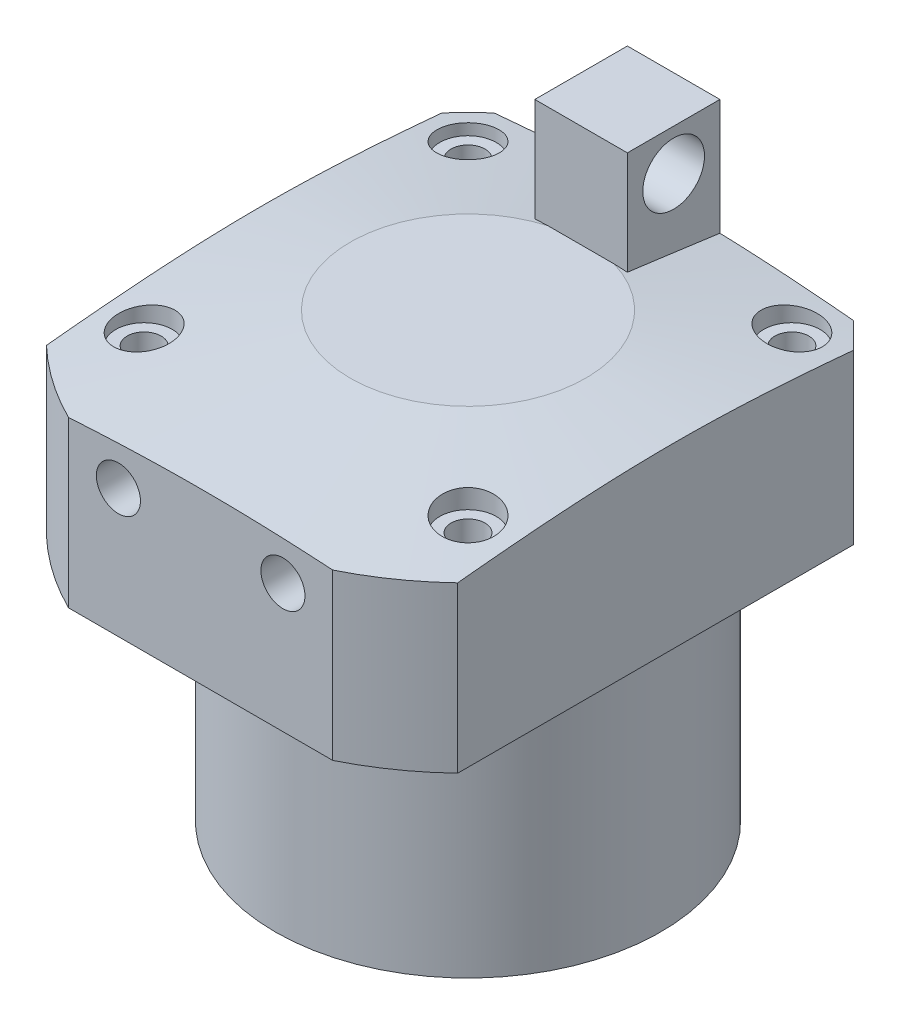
ISO-10303-21;
HEADER;
FILE_DESCRIPTION(('STEP AP214'),'2;1');
FILE_NAME('part.step','',(''),(''),'','','');
FILE_SCHEMA(('AUTOMOTIVE_DESIGN { 1 0 10303 214 1 1 1 1 }'));
ENDSEC;
DATA;
#1=APPLICATION_CONTEXT('core data for automotive mechanical design processes');
#2=APPLICATION_PROTOCOL_DEFINITION('international standard','automotive_design',2000,#1);
#3=PRODUCT_CONTEXT('',#1,'mechanical');
#4=PRODUCT('Part','Part','',(#3));
#5=PRODUCT_RELATED_PRODUCT_CATEGORY('part','',(#4));
#6=PRODUCT_DEFINITION_FORMATION('','',#4);
#7=PRODUCT_DEFINITION_CONTEXT('part definition',#1,'design');
#8=PRODUCT_DEFINITION('design','',#6,#7);
#9=PRODUCT_DEFINITION_SHAPE('','',#8);
#10=(LENGTH_UNIT() NAMED_UNIT(*) SI_UNIT(.MILLI.,.METRE.));
#11=(NAMED_UNIT(*) PLANE_ANGLE_UNIT() SI_UNIT($,.RADIAN.));
#12=(NAMED_UNIT(*) SI_UNIT($,.STERADIAN.) SOLID_ANGLE_UNIT());
#13=UNCERTAINTY_MEASURE_WITH_UNIT(LENGTH_MEASURE(1.E-05),#10,'distance_accuracy_value','');
#14=(GEOMETRIC_REPRESENTATION_CONTEXT(3) GLOBAL_UNCERTAINTY_ASSIGNED_CONTEXT((#13)) GLOBAL_UNIT_ASSIGNED_CONTEXT((#10,
#11,#12)) REPRESENTATION_CONTEXT('',''));
#15=CARTESIAN_POINT('',(0.,0.,0.));
#16=DIRECTION('',(0.,0.,1.));
#17=DIRECTION('',(1.,0.,0.));
#18=AXIS2_PLACEMENT_3D('',#15,#16,#17);
#19=CARTESIAN_POINT('',(-37.5,49.,0.));
#20=DIRECTION('',(0.,-1.,0.));
#21=DIRECTION('',(0.,0.,-1.));
#22=AXIS2_PLACEMENT_3D('',#19,#20,#21);
#23=PLANE('',#22);
#24=CARTESIAN_POINT('',(-16.,49.,45.));
#25=DIRECTION('',(0.,-1.,0.));
#26=DIRECTION('',(0.,0.,-1.));
#27=AXIS2_PLACEMENT_3D('',#24,#25,#26);
#28=CIRCLE('',#27,3.99999999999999);
#29=CARTESIAN_POINT('',(-16.,49.,41.));
#30=VERTEX_POINT('',#29);
#31=EDGE_CURVE('E521',#30,#30,#28,.T.);
#32=ORIENTED_EDGE('',*,*,#31,.F.);
#33=EDGE_LOOP('',(#32));
#34=FACE_BOUND('',#33,.T.);
#35=CARTESIAN_POINT('',(16.,49.,45.));
#36=DIRECTION('',(0.,-1.,0.));
#37=DIRECTION('',(0.,0.,-1.));
#38=AXIS2_PLACEMENT_3D('',#35,#36,#37);
#39=CIRCLE('',#38,3.99999999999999);
#40=CARTESIAN_POINT('',(16.,49.,41.));
#41=VERTEX_POINT('',#40);
#42=EDGE_CURVE('E515',#41,#41,#39,.T.);
#43=ORIENTED_EDGE('',*,*,#42,.F.);
#44=EDGE_LOOP('',(#43));
#45=FACE_BOUND('',#44,.T.);
#46=CARTESIAN_POINT('',(-31.5,49.,-31.5));
#47=DIRECTION('',(0.,1.,0.));
#48=DIRECTION('',(0.,0.,1.));
#49=AXIS2_PLACEMENT_3D('',#46,#47,#48);
#50=CIRCLE('',#49,3.32499999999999);
#51=CARTESIAN_POINT('',(-31.5,49.,-28.175));
#52=VERTEX_POINT('',#51);
#53=EDGE_CURVE('E509',#52,#52,#50,.T.);
#54=ORIENTED_EDGE('',*,*,#53,.T.);
#55=EDGE_LOOP('',(#54));
#56=FACE_BOUND('',#55,.T.);
#57=CARTESIAN_POINT('',(31.5,49.,-31.5));
#58=DIRECTION('',(0.,1.,0.));
#59=DIRECTION('',(0.,0.,1.));
#60=AXIS2_PLACEMENT_3D('',#57,#58,#59);
#61=CIRCLE('',#60,3.32499999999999);
#62=CARTESIAN_POINT('',(31.5,49.,-28.175));
#63=VERTEX_POINT('',#62);
#64=EDGE_CURVE('E226',#63,#63,#61,.T.);
#65=ORIENTED_EDGE('',*,*,#64,.T.);
#66=EDGE_LOOP('',(#65));
#67=FACE_BOUND('',#66,.T.);
#68=CARTESIAN_POINT('',(31.5,49.,31.5));
#69=DIRECTION('',(0.,1.,0.));
#70=DIRECTION('',(0.,0.,1.));
#71=AXIS2_PLACEMENT_3D('',#68,#69,#70);
#72=CIRCLE('',#71,3.32499999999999);
#73=CARTESIAN_POINT('',(31.5,49.,34.825));
#74=VERTEX_POINT('',#73);
#75=EDGE_CURVE('E487',#74,#74,#72,.T.);
#76=ORIENTED_EDGE('',*,*,#75,.T.);
#77=EDGE_LOOP('',(#76));
#78=FACE_BOUND('',#77,.T.);
#79=CARTESIAN_POINT('',(-31.5,49.,31.5));
#80=DIRECTION('',(0.,1.,0.));
#81=DIRECTION('',(0.,0.,1.));
#82=AXIS2_PLACEMENT_3D('',#79,#80,#81);
#83=CIRCLE('',#82,3.32499999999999);
#84=CARTESIAN_POINT('',(-31.5,49.,34.825));
#85=VERTEX_POINT('',#84);
#86=EDGE_CURVE('E299',#85,#85,#83,.T.);
#87=ORIENTED_EDGE('',*,*,#86,.T.);
#88=EDGE_LOOP('',(#87));
#89=FACE_BOUND('',#88,.T.);
#90=CARTESIAN_POINT('',(0.,49.,0.));
#91=DIRECTION('',(0.,1.,0.));
#92=DIRECTION('',(0.,0.,1.));
#93=AXIS2_PLACEMENT_3D('',#90,#91,#92);
#94=CIRCLE('',#93,37.5);
#95=CARTESIAN_POINT('',(0.,49.,37.5));
#96=VERTEX_POINT('',#95);
#97=EDGE_CURVE('E419',#96,#96,#94,.T.);
#98=ORIENTED_EDGE('',*,*,#97,.T.);
#99=EDGE_LOOP('',(#98));
#100=FACE_BOUND('',#99,.T.);
#101=DIRECTION('',(1.,0.,0.));
#102=VECTOR('',#101,1.);
#103=CARTESIAN_POINT('',(-37.5,49.,-40.));
#104=LINE('',#103,#102);
#105=CARTESIAN_POINT('',(-35.,49.,-40.));
#106=VERTEX_POINT('',#105);
#107=CARTESIAN_POINT('',(34.9999999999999,49.,-40.));
#108=VERTEX_POINT('',#107);
#109=EDGE_CURVE('E454',#106,#108,#104,.T.);
#110=ORIENTED_EDGE('',*,*,#109,.T.);
#111=DIRECTION('',(-0.707106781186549,0.,-0.707106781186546));
#112=VECTOR('',#111,1.);
#113=CARTESIAN_POINT('',(18.7499999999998,49.,-56.2500000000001));
#114=LINE('',#113,#112);
#115=CARTESIAN_POINT('',(40.,49.,-35.));
#116=VERTEX_POINT('',#115);
#117=EDGE_CURVE('E45',#108,#116,#114,.F.);
#118=ORIENTED_EDGE('',*,*,#117,.T.);
#119=DIRECTION('',(0.,0.,1.));
#120=VECTOR('',#119,1.);
#121=CARTESIAN_POINT('',(40.,49.,0.));
#122=LINE('',#121,#120);
#123=CARTESIAN_POINT('',(40.,49.,42.));
#124=VERTEX_POINT('',#123);
#125=EDGE_CURVE('E434',#116,#124,#122,.T.);
#126=ORIENTED_EDGE('',*,*,#125,.T.);
#127=CARTESIAN_POINT('',(0.,49.,0.));
#128=DIRECTION('',(0.,1.,0.));
#129=DIRECTION('',(0.,0.,1.));
#130=AXIS2_PLACEMENT_3D('',#127,#128,#129);
#131=CIRCLE('',#130,58.);
#132=CARTESIAN_POINT('',(25.6904651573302,49.,52.));
#133=VERTEX_POINT('',#132);
#134=EDGE_CURVE('E422',#133,#124,#131,.T.);
#135=ORIENTED_EDGE('',*,*,#134,.F.);
#136=DIRECTION('',(-1.,0.,0.));
#137=VECTOR('',#136,1.);
#138=CARTESIAN_POINT('',(-37.5,49.,52.));
#139=LINE('',#138,#137);
#140=CARTESIAN_POINT('',(-25.6904651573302,49.,52.));
#141=VERTEX_POINT('',#140);
#142=EDGE_CURVE('E439',#133,#141,#139,.T.);
#143=ORIENTED_EDGE('',*,*,#142,.T.);
#144=CARTESIAN_POINT('',(-40.,49.,42.));
#145=VERTEX_POINT('',#144);
#146=EDGE_CURVE('E427',#145,#141,#131,.T.);
#147=ORIENTED_EDGE('',*,*,#146,.F.);
#148=DIRECTION('',(0.,0.,-1.));
#149=VECTOR('',#148,1.);
#150=CARTESIAN_POINT('',(-40.,49.,0.));
#151=LINE('',#150,#149);
#152=CARTESIAN_POINT('',(-40.,49.,-35.));
#153=VERTEX_POINT('',#152);
#154=EDGE_CURVE('E448',#145,#153,#151,.T.);
#155=ORIENTED_EDGE('',*,*,#154,.T.);
#156=DIRECTION('',(-0.707106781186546,0.,0.707106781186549));
#157=VECTOR('',#156,1.);
#158=CARTESIAN_POINT('',(-56.25,49.,-18.7499999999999));
#159=LINE('',#158,#157);
#160=EDGE_CURVE('E400',#153,#106,#159,.F.);
#161=ORIENTED_EDGE('',*,*,#160,.T.);
#162=EDGE_LOOP('',(#110,#118,#126,#135,#143,#147,#155,#161));
#163=FACE_BOUND('',#162,.T.);
#164=ADVANCED_FACE('F35',(#34,#45,#56,#67,#78,#89,#100,#163),#23,.T.);
#165=CARTESIAN_POINT('',(0.,87.0508296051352,0.));
#166=DIRECTION('',(0.,1.,0.));
#167=DIRECTION('',(0.,0.,1.));
#168=AXIS2_PLACEMENT_3D('',#165,#166,#167);
#169=CYLINDRICAL_SURFACE('',#168,58.);
#170=ORIENTED_EDGE('',*,*,#134,.T.);
#171=DIRECTION('',(0.,1.,0.));
#172=VECTOR('',#171,1.);
#173=CARTESIAN_POINT('',(40.,87.0508296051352,42.));
#174=LINE('',#173,#172);
#175=CARTESIAN_POINT('',(40.,81.0695600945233,42.));
#176=VERTEX_POINT('',#175);
#177=EDGE_CURVE('E436',#124,#176,#174,.T.);
#178=ORIENTED_EDGE('',*,*,#177,.T.);
#179=CARTESIAN_POINT('',(0.,81.0695600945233,0.));
#180=DIRECTION('',(0.,1.,0.));
#181=DIRECTION('',(0.,0.,1.));
#182=AXIS2_PLACEMENT_3D('',#179,#180,#181);
#183=CIRCLE('',#182,58.);
#184=CARTESIAN_POINT('',(25.6904651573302,81.0695600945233,52.));
#185=VERTEX_POINT('',#184);
#186=EDGE_CURVE('E428',#185,#176,#183,.T.);
#187=ORIENTED_EDGE('',*,*,#186,.F.);
#188=DIRECTION('',(0.,1.,0.));
#189=VECTOR('',#188,1.);
#190=CARTESIAN_POINT('',(25.6904651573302,87.0508296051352,52.));
#191=LINE('',#190,#189);
#192=EDGE_CURVE('E442',#185,#133,#191,.F.);
#193=ORIENTED_EDGE('',*,*,#192,.T.);
#194=EDGE_LOOP('',(#170,#178,#187,#193));
#195=FACE_BOUND('',#194,.T.);
#196=ADVANCED_FACE('F242',(#195),#169,.T.);
#197=ORIENTED_EDGE('',*,*,#146,.T.);
#198=DIRECTION('',(0.,1.,0.));
#199=VECTOR('',#198,1.);
#200=CARTESIAN_POINT('',(-25.6904651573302,87.0508296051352,52.));
#201=LINE('',#200,#199);
#202=CARTESIAN_POINT('',(-25.6904651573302,81.0695600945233,52.));
#203=VERTEX_POINT('',#202);
#204=EDGE_CURVE('E445',#141,#203,#201,.T.);
#205=ORIENTED_EDGE('',*,*,#204,.T.);
#206=CARTESIAN_POINT('',(-40.,81.0695600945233,42.));
#207=VERTEX_POINT('',#206);
#208=EDGE_CURVE('E430',#207,#203,#183,.T.);
#209=ORIENTED_EDGE('',*,*,#208,.F.);
#210=DIRECTION('',(0.,1.,0.));
#211=VECTOR('',#210,1.);
#212=CARTESIAN_POINT('',(-40.,87.0508296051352,42.));
#213=LINE('',#212,#211);
#214=EDGE_CURVE('E451',#207,#145,#213,.F.);
#215=ORIENTED_EDGE('',*,*,#214,.T.);
#216=EDGE_LOOP('',(#197,#205,#209,#215));
#217=FACE_BOUND('',#216,.T.);
#218=ADVANCED_FACE('F239',(#217),#169,.T.);
#219=CARTESIAN_POINT('',(0.,86.,0.));
#220=DIRECTION('',(0.,-1.,0.));
#221=DIRECTION('',(0.,0.,-1.));
#222=AXIS2_PLACEMENT_3D('',#219,#220,#221);
#223=CONICAL_SURFACE('',#222,22.9180971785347,1.43116998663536);
#224=CARTESIAN_POINT('',(-9.,87.9118434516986,-2.40046316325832));
#225=CARTESIAN_POINT('',(-9.,87.8977219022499,-2.79091235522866));
#226=CARTESIAN_POINT('',(-9.,87.8803433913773,-3.18122819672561));
#227=CARTESIAN_POINT('',(-9.,87.8398826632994,-3.96153912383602));
#228=CARTESIAN_POINT('',(-9.,87.8168008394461,-4.35153422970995));
#229=CARTESIAN_POINT('',(-9.,87.7402272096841,-5.5208039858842));
#230=CARTESIAN_POINT('',(-9.,87.6793977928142,-6.2995975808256));
#231=CARTESIAN_POINT('',(-9.,87.5779894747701,-7.46669715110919));
#232=CARTESIAN_POINT('',(-9.,87.5425010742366,-7.85546810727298));
#233=CARTESIAN_POINT('',(-9.,87.4687166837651,-8.63274344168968));
#234=CARTESIAN_POINT('',(-9.,87.4304207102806,-9.02124782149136));
#235=CARTESIAN_POINT('',(-9.,87.3515245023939,-9.79805782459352));
#236=CARTESIAN_POINT('',(-9.,87.3109240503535,-10.1863634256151));
#237=CARTESIAN_POINT('',(-9.,87.2278280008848,-10.9627718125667));
#238=CARTESIAN_POINT('',(-9.,87.1853324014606,-11.3508745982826));
#239=CARTESIAN_POINT('',(-9.,87.0814306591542,-12.2824702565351));
#240=CARTESIAN_POINT('',(-9.,87.0192735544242,-12.8258792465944));
#241=CARTESIAN_POINT('',(-9.,86.8925951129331,-13.9124221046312));
#242=CARTESIAN_POINT('',(-9.,86.8280737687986,-14.4555559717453));
#243=CARTESIAN_POINT('',(-9.,86.6317686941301,-16.084636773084));
#244=CARTESIAN_POINT('',(-9.,86.4972450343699,-17.1702531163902));
#245=CARTESIAN_POINT('',(-9.,86.223609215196,-19.3408946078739));
#246=CARTESIAN_POINT('',(-9.,86.0844970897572,-20.4259197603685));
#247=CARTESIAN_POINT('',(-9.,85.8032005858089,-22.5955646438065));
#248=CARTESIAN_POINT('',(-9.,85.6610162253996,-23.6801843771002));
#249=CARTESIAN_POINT('',(-9.,85.3744373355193,-25.8497671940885));
#250=CARTESIAN_POINT('',(-9.,85.2300415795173,-26.9347301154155));
#251=CARTESIAN_POINT('',(-9.,84.9397128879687,-29.1044515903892));
#252=CARTESIAN_POINT('',(-9.,84.7937799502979,-30.1892101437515));
#253=CARTESIAN_POINT('',(-9.,84.3543056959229,-33.4432365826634));
#254=CARTESIAN_POINT('',(-9.,84.0590859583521,-35.6122776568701));
#255=CARTESIAN_POINT('',(-9.,83.5614440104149,-39.252146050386));
#256=CARTESIAN_POINT('',(-9.,83.3597273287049,-40.7230701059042));
#257=CARTESIAN_POINT('',(-9.,82.9553923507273,-43.664794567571));
#258=CARTESIAN_POINT('',(-9.,82.7527740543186,-45.1355949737));
#259=CARTESIAN_POINT('',(-9.,82.1439218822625,-49.5478691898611));
#260=CARTESIAN_POINT('',(-9.,81.7366921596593,-52.4892055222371));
#261=CARTESIAN_POINT('',(-9.,80.9210165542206,-58.3690261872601));
#262=CARTESIAN_POINT('',(-9.,80.5125720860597,-61.3075107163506));
#263=CARTESIAN_POINT('',(-9.,79.6946059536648,-67.1843169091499));
#264=CARTESIAN_POINT('',(-9.,79.2850842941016,-70.1226385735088));
#265=CARTESIAN_POINT('',(-9.,78.8752729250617,-73.0609196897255));
#266=B_SPLINE_CURVE_WITH_KNOTS('',3,(#224,#225,#226,#227,#228,#229,#230,#231,#232,#233,#234,
#235,#236,#237,#238,#239,#240,#241,#242,#243,#244,#245,#246,#247,#248,#249,#250,#251,#252,#253,
#254,#255,#256,#257,#258,#259,#260,#261,#262,#263,#264,#265),.UNSPECIFIED.,.F.,.F.,(4,2,2,2,2,2,
2,2,2,2,2,2,2,2,2,2,2,2,2,2,4),(0.,1.17207611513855,2.34407141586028,4.68735815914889,
5.85851636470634,7.02966770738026,8.20092983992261,9.37219320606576,11.0130429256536,
12.6538977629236,15.9356369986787,19.2173519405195,22.4990475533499,25.7826344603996,
29.0662259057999,35.6333409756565,40.0874136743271,44.5414870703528,53.44966558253,
62.3498712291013,71.2500383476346),.UNSPECIFIED.);
#267=CARTESIAN_POINT('',(-9.,85.8803110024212,-22.));
#268=VERTEX_POINT('',#267);
#269=CARTESIAN_POINT('',(-9.00000000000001,83.4587542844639,-40.));
#270=VERTEX_POINT('',#269);
#271=EDGE_CURVE('E164',#268,#270,#266,.T.);
#272=ORIENTED_EDGE('',*,*,#271,.T.);
#273=CARTESIAN_POINT('',(-79.7770752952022,76.6785887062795,-40.));
#274=CARTESIAN_POINT('',(-77.7003874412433,76.9394472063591,-40.));
#275=CARTESIAN_POINT('',(-75.6234540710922,77.1983716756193,-40.));
#276=CARTESIAN_POINT('',(-71.4689717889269,77.7113161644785,-40.));
#277=CARTESIAN_POINT('',(-69.3914228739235,77.9653361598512,-40.));
#278=CARTESIAN_POINT('',(-65.2356708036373,78.4674248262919,-40.));
#279=CARTESIAN_POINT('',(-63.1574676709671,78.715493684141,-40.));
#280=CARTESIAN_POINT('',(-59.0001965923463,79.2042756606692,-40.));
#281=CARTESIAN_POINT('',(-56.9211286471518,79.4449887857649,-40.));
#282=CARTESIAN_POINT('',(-52.7648822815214,79.9169185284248,-40.));
#283=CARTESIAN_POINT('',(-50.6877053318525,80.1481480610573,-40.));
#284=CARTESIAN_POINT('',(-46.5320993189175,80.5991264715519,-40.));
#285=CARTESIAN_POINT('',(-44.453670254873,80.8188753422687,-40.));
#286=CARTESIAN_POINT('',(-40.2950288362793,81.243888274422,-40.));
#287=CARTESIAN_POINT('',(-38.2148162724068,81.4491502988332,-40.));
#288=CARTESIAN_POINT('',(-34.0526412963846,81.8412670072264,-40.));
#289=CARTESIAN_POINT('',(-31.9706788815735,82.0281216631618,-40.));
#290=CARTESIAN_POINT('',(-27.7979259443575,82.3791400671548,-40.));
#291=CARTESIAN_POINT('',(-25.7071289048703,82.5432271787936,-40.));
#292=CARTESIAN_POINT('',(-21.5234224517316,82.8421480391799,-40.));
#293=CARTESIAN_POINT('',(-19.4305130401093,82.9769818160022,-40.));
#294=CARTESIAN_POINT('',(-15.2433076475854,83.210976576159,-40.));
#295=CARTESIAN_POINT('',(-13.1490123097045,83.3101487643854,-40.));
#296=CARTESIAN_POINT('',(-10.0064247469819,83.4278040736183,-40.));
#297=CARTESIAN_POINT('',(-8.95870268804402,83.4618387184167,-40.));
#298=CARTESIAN_POINT('',(-6.86295645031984,83.5189800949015,-40.));
#299=CARTESIAN_POINT('',(-5.81493227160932,83.5420868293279,-40.));
#300=CARTESIAN_POINT('',(-3.71755717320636,83.5769677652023,-40.));
#301=CARTESIAN_POINT('',(-2.66820604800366,83.5887296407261,-40.));
#302=CARTESIAN_POINT('',(-0.569437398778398,83.6006568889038,-40.));
#303=CARTESIAN_POINT('',(0.479980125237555,83.6008222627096,-40.));
#304=CARTESIAN_POINT('',(2.5787537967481,83.5895529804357,-40.));
#305=CARTESIAN_POINT('',(3.62810994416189,83.5781183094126,-40.));
#306=CARTESIAN_POINT('',(5.72663554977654,83.543864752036,-40.));
#307=CARTESIAN_POINT('',(6.77580500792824,83.5210458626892,-40.));
#308=CARTESIAN_POINT('',(8.87413845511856,83.4644306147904,-40.));
#309=CARTESIAN_POINT('',(9.92330236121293,83.4306311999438,-40.));
#310=CARTESIAN_POINT('',(12.0212442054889,83.3526345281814,-40.));
#311=CARTESIAN_POINT('',(13.070022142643,83.3084372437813,-40.));
#312=CARTESIAN_POINT('',(15.1671158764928,83.2103409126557,-40.));
#313=CARTESIAN_POINT('',(16.215431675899,83.1564419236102,-40.));
#314=CARTESIAN_POINT('',(18.3115622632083,83.0397079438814,-40.));
#315=CARTESIAN_POINT('',(19.3593770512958,82.9768729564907,-40.));
#316=CARTESIAN_POINT('',(21.9154013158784,82.8136245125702,-40.));
#317=CARTESIAN_POINT('',(23.4233320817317,82.7088412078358,-40.));
#318=CARTESIAN_POINT('',(26.4381184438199,82.4847297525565,-40.));
#319=CARTESIAN_POINT('',(27.9449740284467,82.3654014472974,-40.));
#320=CARTESIAN_POINT('',(30.9577159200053,82.1143571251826,-40.));
#321=CARTESIAN_POINT('',(32.4636021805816,81.9826405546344,-40.));
#322=CARTESIAN_POINT('',(35.4744133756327,81.7087384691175,-40.));
#323=CARTESIAN_POINT('',(36.9793383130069,81.5665529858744,-40.));
#324=CARTESIAN_POINT('',(39.9885972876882,81.2733323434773,-40.));
#325=CARTESIAN_POINT('',(41.4929311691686,81.1222955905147,-40.));
#326=CARTESIAN_POINT('',(44.5008325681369,80.8127861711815,-40.));
#327=CARTESIAN_POINT('',(46.0044000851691,80.6543135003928,-40.));
#328=CARTESIAN_POINT('',(49.0108262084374,80.3310970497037,-40.));
#329=CARTESIAN_POINT('',(50.5136848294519,80.1663534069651,-40.));
#330=CARTESIAN_POINT('',(53.5188088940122,79.8315551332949,-40.));
#331=CARTESIAN_POINT('',(55.0210743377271,79.6615005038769,-40.));
#332=CARTESIAN_POINT('',(58.0261045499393,79.3167626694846,-40.));
#333=CARTESIAN_POINT('',(59.5288689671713,79.1420764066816,-40.));
#334=CARTESIAN_POINT('',(62.5339444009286,78.7888434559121,-40.));
#335=CARTESIAN_POINT('',(64.0362554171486,78.6102967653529,-40.));
#336=CARTESIAN_POINT('',(68.5426035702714,78.0697148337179,-40.));
#337=CARTESIAN_POINT('',(71.5460481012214,77.7027386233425,-40.));
#338=CARTESIAN_POINT('',(77.5513940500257,76.9590247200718,-40.));
#339=CARTESIAN_POINT('',(80.5532955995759,76.5822880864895,-40.));
#340=CARTESIAN_POINT('',(86.5561462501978,75.8213436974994,-40.));
#341=CARTESIAN_POINT('',(89.5570953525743,75.4371359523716,-40.));
#342=CARTESIAN_POINT('',(95.5527207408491,74.6636436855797,-40.));
#343=CARTESIAN_POINT('',(98.5473984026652,74.2743698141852,-40.));
#344=CARTESIAN_POINT('',(104.536159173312,73.4912726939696,-40.));
#345=CARTESIAN_POINT('',(107.530242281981,73.0974494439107,-40.));
#346=CARTESIAN_POINT('',(113.518026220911,72.3061486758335,-40.));
#347=CARTESIAN_POINT('',(116.511727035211,71.9086710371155,-40.));
#348=CARTESIAN_POINT('',(122.49873495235,71.1107611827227,-40.));
#349=CARTESIAN_POINT('',(125.492042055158,70.7103289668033,-40.));
#350=CARTESIAN_POINT('',(131.474030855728,69.9076150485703,-40.));
#351=CARTESIAN_POINT('',(134.462713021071,69.5053368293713,-40.));
#352=CARTESIAN_POINT('',(140.439806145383,68.6987698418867,-40.));
#353=CARTESIAN_POINT('',(143.428217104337,68.294481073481,-40.));
#354=CARTESIAN_POINT('',(149.404701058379,67.4842343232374,-40.));
#355=CARTESIAN_POINT('',(152.392774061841,67.0782764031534,-40.));
#356=CARTESIAN_POINT('',(158.368724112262,66.2649248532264,-40.));
#357=CARTESIAN_POINT('',(161.356601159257,65.8575312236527,-40.));
#358=CARTESIAN_POINT('',(164.344396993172,65.4495437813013,-40.));
#359=B_SPLINE_CURVE_WITH_KNOTS('',3,(#273,#274,#275,#276,#277,#278,#279,#280,#281,#282,#283,
#284,#285,#286,#287,#288,#289,#290,#291,#292,#293,#294,#295,#296,#297,#298,#299,#300,#301,#302,
#303,#304,#305,#306,#307,#308,#309,#310,#311,#312,#313,#314,#315,#316,#317,#318,#319,#320,#321,
#322,#323,#324,#325,#326,#327,#328,#329,#330,#331,#332,#333,#334,#335,#336,#337,#338,#339,#340,
#341,#342,#343,#344,#345,#346,#347,#348,#349,#350,#351,#352,#353,#354,#355,#356,#357,#358),
.UNSPECIFIED.,.F.,.F.,(4,2,2,2,2,2,2,2,2,2,2,2,2,2,2,2,2,2,2,2,2,2,2,2,2,2,2,2,2,2,2,2,2,2,2,2,
2,2,2,2,2,2,4),(0.,6.27902485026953,12.5580807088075,18.8369392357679,25.1157922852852,
31.3857896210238,37.6557908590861,43.9266719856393,50.1975626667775,56.4890743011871,
62.7805798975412,69.0701069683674,72.2148831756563,75.3596585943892,78.507846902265,
81.6560348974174,84.804226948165,87.9524198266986,91.1014897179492,94.2505679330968,
97.3996274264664,100.548685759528,105.083298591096,109.617959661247,114.152823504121,
118.687673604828,123.223342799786,127.759014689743,132.294587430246,136.830158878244,
141.368803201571,145.907450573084,154.984768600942,164.061105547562,173.137430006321,
182.19704252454,191.256657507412,200.316572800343,209.376488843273,218.423390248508,
227.470292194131,236.516862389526,245.56343088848),.UNSPECIFIED.);
#360=CARTESIAN_POINT('',(-35.,81.7510806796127,-40.));
#361=VERTEX_POINT('',#360);
#362=EDGE_CURVE('E416',#270,#361,#359,.F.);
#363=ORIENTED_EDGE('',*,*,#362,.T.);
#364=CARTESIAN_POINT('',(-35.,81.7510806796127,-40.));
#365=CARTESIAN_POINT('',(-35.8333333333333,81.762110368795,-39.1666666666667));
#366=CARTESIAN_POINT('',(-36.6666666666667,81.7676252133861,-38.3333333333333));
#367=CARTESIAN_POINT('',(-38.3333333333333,81.7676252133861,-36.6666666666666));
#368=CARTESIAN_POINT('',(-39.1666666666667,81.762110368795,-35.8333333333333));
#369=CARTESIAN_POINT('',(-40.,81.7510806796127,-35.));
#370=B_SPLINE_CURVE_WITH_KNOTS('',3,(#364,#365,#366,#367,#368,#369),.UNSPECIFIED.,.F.,.F.,(4,2,
4),(0.,3.53557261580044,7.07114523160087),.UNSPECIFIED.);
#371=CARTESIAN_POINT('',(-40.,81.7510806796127,-34.9999999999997));
#372=VERTEX_POINT('',#371);
#373=EDGE_CURVE('E277',#361,#372,#370,.T.);
#374=ORIENTED_EDGE('',*,*,#373,.T.);
#375=CARTESIAN_POINT('',(-40.,75.8169457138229,-86.5809206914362));
#376=CARTESIAN_POINT('',(-40.,76.0956772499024,-84.3959088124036));
#377=CARTESIAN_POINT('',(-40.,76.3726565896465,-82.2106713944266));
#378=CARTESIAN_POINT('',(-40.,76.922168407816,-77.8396296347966));
#379=CARTESIAN_POINT('',(-40.,77.1947008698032,-75.6538252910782));
#380=CARTESIAN_POINT('',(-40.,77.7343479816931,-71.2817639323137));
#381=CARTESIAN_POINT('',(-40.,78.0014631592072,-69.095506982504));
#382=CARTESIAN_POINT('',(-40.,78.5290116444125,-64.7221870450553));
#383=CARTESIAN_POINT('',(-40.,78.7894449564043,-62.5351240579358));
#384=CARTESIAN_POINT('',(-40.,79.3016627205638,-58.1625951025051));
#385=CARTESIAN_POINT('',(-40.,79.5534570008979,-55.9771302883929));
#386=CARTESIAN_POINT('',(-40.,80.0465347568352,-51.6050101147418));
#387=CARTESIAN_POINT('',(-40.,80.2878182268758,-49.4183547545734));
#388=CARTESIAN_POINT('',(-40.,80.7570432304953,-45.0432116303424));
#389=CARTESIAN_POINT('',(-40.,80.9849823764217,-42.8547236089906));
#390=CARTESIAN_POINT('',(-40.,81.42370360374,-38.4760145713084));
#391=CARTESIAN_POINT('',(-40.,81.6344856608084,-36.2857935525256));
#392=CARTESIAN_POINT('',(-40.,82.0346715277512,-31.8962368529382));
#393=CARTESIAN_POINT('',(-40.,82.2240039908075,-29.6968946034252));
#394=CARTESIAN_POINT('',(-40.,82.5743771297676,-25.2959317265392));
#395=CARTESIAN_POINT('',(-40.,82.7354177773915,-23.0943110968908));
#396=CARTESIAN_POINT('',(-40.,83.0219874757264,-18.6894935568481));
#397=CARTESIAN_POINT('',(-40.,83.1475292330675,-16.4862974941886));
#398=CARTESIAN_POINT('',(-40.,83.3037856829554,-13.1799999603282));
#399=CARTESIAN_POINT('',(-40.,83.3505285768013,-12.0776463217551));
#400=CARTESIAN_POINT('',(-40.,83.4325283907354,-9.87251474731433));
#401=CARTESIAN_POINT('',(-40.,83.4677853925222,-8.76973681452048));
#402=CARTESIAN_POINT('',(-40.,83.5261762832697,-6.56262180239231));
#403=CARTESIAN_POINT('',(-40.,83.5492965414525,-5.45828436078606));
#404=CARTESIAN_POINT('',(-40.,83.5828874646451,-3.24941590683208));
#405=CARTESIAN_POINT('',(-40.,83.5933581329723,-2.14488489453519));
#406=CARTESIAN_POINT('',(-40.,83.6014300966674,0.0642207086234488));
#407=CARTESIAN_POINT('',(-40.,83.5990314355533,1.16879529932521));
#408=CARTESIAN_POINT('',(-40.,83.5814156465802,3.37784168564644));
#409=CARTESIAN_POINT('',(-40.,83.5661985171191,4.48231348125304));
#410=CARTESIAN_POINT('',(-40.,83.5232551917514,6.69133884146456));
#411=CARTESIAN_POINT('',(-40.,83.4955252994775,7.7958923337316));
#412=CARTESIAN_POINT('',(-40.,83.4281046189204,10.0046348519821));
#413=CARTESIAN_POINT('',(-40.,83.3884137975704,11.1088238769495));
#414=CARTESIAN_POINT('',(-40.,83.2978028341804,13.3167314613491));
#415=CARTESIAN_POINT('',(-40.,83.2468827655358,14.420450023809));
#416=CARTESIAN_POINT('',(-40.,83.1346657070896,16.6273533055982));
#417=CARTESIAN_POINT('',(-40.,83.0733687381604,17.7305380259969));
#418=CARTESIAN_POINT('',(-40.,82.9036207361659,20.5659463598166));
#419=CARTESIAN_POINT('',(-40.,82.7882268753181,22.2977556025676));
#420=CARTESIAN_POINT('',(-40.,82.5376659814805,25.7599529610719));
#421=CARTESIAN_POINT('',(-40.,82.4024986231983,27.4903410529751));
#422=CARTESIAN_POINT('',(-40.,82.1156994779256,30.9498628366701));
#423=CARTESIAN_POINT('',(-40.,81.9640665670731,32.6789964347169));
#424=CARTESIAN_POINT('',(-40.,81.6472330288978,36.1360045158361));
#425=CARTESIAN_POINT('',(-40.,81.4820324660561,37.8638790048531));
#426=CARTESIAN_POINT('',(-40.,81.1404416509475,41.3189743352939));
#427=CARTESIAN_POINT('',(-40.,80.9640484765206,43.0461948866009));
#428=CARTESIAN_POINT('',(-40.,80.6021003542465,46.4996740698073));
#429=CARTESIAN_POINT('',(-40.,80.4165453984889,48.225932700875));
#430=CARTESIAN_POINT('',(-40.,80.037892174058,51.677560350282));
#431=CARTESIAN_POINT('',(-40.,79.8447941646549,53.4029293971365));
#432=CARTESIAN_POINT('',(-40.,79.4523471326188,56.8529542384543));
#433=CARTESIAN_POINT('',(-40.,79.2529981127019,58.5776100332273));
#434=CARTESIAN_POINT('',(-40.,78.8488990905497,62.0279943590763));
#435=CARTESIAN_POINT('',(-40.,78.6441440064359,63.7537222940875));
#436=CARTESIAN_POINT('',(-40.,78.2302594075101,67.2046539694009));
#437=CARTESIAN_POINT('',(-40.,78.021129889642,68.929857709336));
#438=CARTESIAN_POINT('',(-40.,77.3882396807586,74.1048140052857));
#439=CARTESIAN_POINT('',(-40.,76.9589794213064,77.5538939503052));
#440=CARTESIAN_POINT('',(-40.,76.0899376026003,84.4501767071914));
#441=CARTESIAN_POINT('',(-40.,75.6501576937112,87.8973797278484));
#442=CARTESIAN_POINT('',(-40.,74.7627131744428,94.7907621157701));
#443=CARTESIAN_POINT('',(-40.,74.3150485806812,98.2369414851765));
#444=CARTESIAN_POINT('',(-40.,73.4141925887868,105.124971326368));
#445=CARTESIAN_POINT('',(-40.,72.9610073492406,108.566822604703));
#446=CARTESIAN_POINT('',(-40.,72.0499993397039,115.449912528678));
#447=CARTESIAN_POINT('',(-40.,71.5921765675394,118.891151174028));
#448=CARTESIAN_POINT('',(-40.,70.6728486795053,125.773307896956));
#449=CARTESIAN_POINT('',(-40.,70.2113433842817,129.214225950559));
#450=CARTESIAN_POINT('',(-40.,69.2853982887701,136.0956672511));
#451=CARTESIAN_POINT('',(-40.,68.8209584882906,139.536190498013));
#452=CARTESIAN_POINT('',(-40.,67.8905625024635,146.410494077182));
#453=CARTESIAN_POINT('',(-40.,67.4246107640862,149.844275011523));
#454=CARTESIAN_POINT('',(-40.,66.490749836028,156.711570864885));
#455=CARTESIAN_POINT('',(-40.,66.022840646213,160.145085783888));
#456=CARTESIAN_POINT('',(-40.,65.0854198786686,167.011714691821));
#457=CARTESIAN_POINT('',(-40.,64.6159083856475,170.444828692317));
#458=CARTESIAN_POINT('',(-40.,63.6755071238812,177.310867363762));
#459=CARTESIAN_POINT('',(-40.,63.2046173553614,180.743792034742));
#460=CARTESIAN_POINT('',(-40.,62.7331625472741,184.176638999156));
#461=B_SPLINE_CURVE_WITH_KNOTS('',3,(#375,#376,#377,#378,#379,#380,#381,#382,#383,#384,#385,
#386,#387,#388,#389,#390,#391,#392,#393,#394,#395,#396,#397,#398,#399,#400,#401,#402,#403,#404,
#405,#406,#407,#408,#409,#410,#411,#412,#413,#414,#415,#416,#417,#418,#419,#420,#421,#422,#423,
#424,#425,#426,#427,#428,#429,#430,#431,#432,#433,#434,#435,#436,#437,#438,#439,#440,#441,#442,
#443,#444,#445,#446,#447,#448,#449,#450,#451,#452,#453,#454,#455,#456,#457,#458,#459,#460),
.UNSPECIFIED.,.F.,.F.,(4,2,2,2,2,2,2,2,2,2,2,2,2,2,2,2,2,2,2,2,2,2,2,2,2,2,2,2,2,2,2,2,2,2,2,2,
2,2,2,2,2,2,4),(0.,6.60815737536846,13.2163391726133,19.8238742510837,26.4314050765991,
33.0311512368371,39.6309008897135,46.2318278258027,52.8327641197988,59.4550493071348,
66.0773411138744,72.6972594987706,76.0072420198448,79.317200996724,82.6308694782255,
85.9445370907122,89.2581934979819,92.5718503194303,95.8864866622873,99.2011321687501,
102.515756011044,105.830373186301,111.037174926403,116.244062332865,121.451305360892,
126.658523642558,131.867107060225,137.075694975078,142.28410401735,147.492510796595,
152.706001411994,157.919495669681,168.346537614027,178.771954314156,189.197349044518,
199.612020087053,210.026696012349,220.441882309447,230.857069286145,241.252820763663,
251.648572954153,262.043783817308,272.438992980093),.UNSPECIFIED.);
#462=EDGE_CURVE('E256',#372,#207,#461,.T.);
#463=ORIENTED_EDGE('',*,*,#462,.T.);
#464=ORIENTED_EDGE('',*,*,#208,.T.);
#465=CARTESIAN_POINT('',(-89.7550651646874,74.6425878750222,52.));
#466=CARTESIAN_POINT('',(-88.5076472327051,74.79427936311,52.));
#467=CARTESIAN_POINT('',(-87.2601347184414,74.9451927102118,52.));
#468=CARTESIAN_POINT('',(-84.7649015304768,75.2452950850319,52.));
#469=CARTESIAN_POINT('',(-83.5171808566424,75.3944841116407,52.));
#470=CARTESIAN_POINT('',(-79.7736615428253,75.8392146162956,52.));
#471=CARTESIAN_POINT('',(-77.2775245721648,76.1319172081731,52.));
#472=CARTESIAN_POINT('',(-72.2838840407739,76.7081150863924,52.));
#473=CARTESIAN_POINT('',(-69.7863803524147,76.9916092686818,52.));
#474=CARTESIAN_POINT('',(-64.7901075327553,77.5472176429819,52.));
#475=CARTESIAN_POINT('',(-62.2913384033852,77.819331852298,52.));
#476=CARTESIAN_POINT('',(-57.2968673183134,78.3489802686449,52.));
#477=CARTESIAN_POINT('',(-54.8011681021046,78.6065402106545,52.));
#478=CARTESIAN_POINT('',(-49.8080177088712,79.1041946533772,52.));
#479=CARTESIAN_POINT('',(-47.3105665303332,79.344289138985,52.));
#480=CARTESIAN_POINT('',(-42.3135293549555,79.8027502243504,52.));
#481=CARTESIAN_POINT('',(-39.8139432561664,80.0211157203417,52.));
#482=CARTESIAN_POINT('',(-34.812539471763,80.4309040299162,52.));
#483=CARTESIAN_POINT('',(-32.3107217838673,80.6223268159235,52.));
#484=CARTESIAN_POINT('',(-27.2967121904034,80.9727659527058,52.));
#485=CARTESIAN_POINT('',(-24.7845127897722,81.1316761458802,52.));
#486=CARTESIAN_POINT('',(-19.7578757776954,81.4097853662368,52.));
#487=CARTESIAN_POINT('',(-17.2434381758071,81.5289845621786,52.));
#488=CARTESIAN_POINT('',(-13.4707457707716,81.6734872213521,52.));
#489=CARTESIAN_POINT('',(-12.2131347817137,81.7159362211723,52.));
#490=CARTESIAN_POINT('',(-9.69756705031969,81.7888174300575,52.));
#491=CARTESIAN_POINT('',(-8.43961030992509,81.8192497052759,52.));
#492=CARTESIAN_POINT('',(-5.92345740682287,81.8676282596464,52.));
#493=CARTESIAN_POINT('',(-4.66526124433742,81.8855745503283,52.));
#494=CARTESIAN_POINT('',(-2.14875085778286,81.9086970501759,52.));
#495=CARTESIAN_POINT('',(-0.890436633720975,81.9138732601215,52.));
#496=CARTESIAN_POINT('',(1.62750343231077,81.9113698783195,52.));
#497=CARTESIAN_POINT('',(2.88712926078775,81.9036767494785,52.));
#498=CARTESIAN_POINT('',(5.40623748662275,81.875534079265,52.));
#499=CARTESIAN_POINT('',(6.66571988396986,81.8550845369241,52.));
#500=CARTESIAN_POINT('',(9.18442588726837,81.8017516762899,52.));
#501=CARTESIAN_POINT('',(10.4436494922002,81.7688683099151,52.));
#502=CARTESIAN_POINT('',(12.9617233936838,81.6911699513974,52.));
#503=CARTESIAN_POINT('',(14.2205736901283,81.6463549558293,52.));
#504=CARTESIAN_POINT('',(17.9970037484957,81.4949221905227,52.));
#505=CARTESIAN_POINT('',(20.5139205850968,81.3713286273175,52.));
#506=CARTESIAN_POINT('',(24.2875626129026,81.1565786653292,52.));
#507=CARTESIAN_POINT('',(25.5451581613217,81.0801018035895,52.));
#508=CARTESIAN_POINT('',(28.0597753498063,80.9181839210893,52.));
#509=CARTESIAN_POINT('',(29.3167969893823,80.8327428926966,52.));
#510=CARTESIAN_POINT('',(33.5892871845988,80.528419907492,52.));
#511=CARTESIAN_POINT('',(36.6033813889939,80.290151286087,52.));
#512=CARTESIAN_POINT('',(42.6284633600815,79.777000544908,52.));
#513=CARTESIAN_POINT('',(45.6394510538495,79.5021175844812,52.));
#514=CARTESIAN_POINT('',(51.6589541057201,78.9241489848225,52.));
#515=CARTESIAN_POINT('',(54.6674692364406,78.6210609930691,52.));
#516=CARTESIAN_POINT('',(60.6822010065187,77.993240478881,52.));
#517=CARTESIAN_POINT('',(63.68841766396,77.6685081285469,52.));
#518=CARTESIAN_POINT('',(69.6999104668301,77.0022278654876,52.));
#519=CARTESIAN_POINT('',(72.7051860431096,76.6606748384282,52.));
#520=CARTESIAN_POINT('',(78.7142272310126,75.9645390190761,52.));
#521=CARTESIAN_POINT('',(81.7179928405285,75.6099562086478,52.));
#522=CARTESIAN_POINT('',(87.7241433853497,74.8905457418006,52.));
#523=CARTESIAN_POINT('',(90.7265283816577,74.5257185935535,52.));
#524=CARTESIAN_POINT('',(96.7302899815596,73.7878877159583,52.));
#525=CARTESIAN_POINT('',(99.7316665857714,73.4148839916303,52.));
#526=CARTESIAN_POINT('',(105.725443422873,72.6633072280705,52.));
#527=CARTESIAN_POINT('',(108.717845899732,72.2847520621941,52.));
#528=CARTESIAN_POINT('',(114.701969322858,71.5222957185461,52.));
#529=CARTESIAN_POINT('',(117.693690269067,71.1383945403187,52.));
#530=CARTESIAN_POINT('',(123.676606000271,70.3661814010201,52.));
#531=CARTESIAN_POINT('',(126.667800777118,69.9778693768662,52.));
#532=CARTESIAN_POINT('',(132.649712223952,69.1975794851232,52.));
#533=CARTESIAN_POINT('',(135.640428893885,68.8056016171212,52.));
#534=CARTESIAN_POINT('',(141.618996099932,68.0188918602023,52.));
#535=CARTESIAN_POINT('',(144.606846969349,67.6241625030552,52.));
#536=CARTESIAN_POINT('',(150.582203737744,66.8321007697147,52.));
#537=CARTESIAN_POINT('',(153.569709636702,66.4347683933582,52.));
#538=CARTESIAN_POINT('',(159.544369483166,65.6378926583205,52.));
#539=CARTESIAN_POINT('',(162.531523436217,65.2383493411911,52.));
#540=CARTESIAN_POINT('',(168.505573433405,64.4373448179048,52.));
#541=CARTESIAN_POINT('',(171.49246947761,64.0358836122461,52.));
#542=CARTESIAN_POINT('',(174.479256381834,63.6336135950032,52.));
#543=B_SPLINE_CURVE_WITH_KNOTS('',3,(#465,#466,#467,#468,#469,#470,#471,#472,#473,#474,#475,
#476,#477,#478,#479,#480,#481,#482,#483,#484,#485,#486,#487,#488,#489,#490,#491,#492,#493,#494,
#495,#496,#497,#498,#499,#500,#501,#502,#503,#504,#505,#506,#507,#508,#509,#510,#511,#512,#513,
#514,#515,#516,#517,#518,#519,#520,#521,#522,#523,#524,#525,#526,#527,#528,#529,#530,#531,#532,
#533,#534,#535,#536,#537,#538,#539,#540,#541,#542),.UNSPECIFIED.,.F.,.F.,(4,2,2,2,2,2,2,2,2,2,2,
2,2,2,2,2,2,2,2,2,2,2,2,2,2,2,2,2,2,2,2,2,2,2,2,2,2,2,4),(0.,3.7698213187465,7.53964506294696,
15.0793498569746,22.619955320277,30.1605493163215,37.6873635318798,45.2141842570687,
52.7413871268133,60.2685977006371,67.8200065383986,75.371383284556,79.1463167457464,
82.9212294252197,86.6961386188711,90.4710475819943,94.2499298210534,98.0288123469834,
101.807709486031,105.586607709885,113.146030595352,116.925764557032,120.705501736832,
129.775663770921,138.846034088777,147.917161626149,156.988217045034,166.062047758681,
175.135891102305,184.209285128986,193.282673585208,202.331424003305,211.380175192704,
220.429055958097,229.477937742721,238.51937306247,247.560808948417,256.602075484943,
265.643339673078),.UNSPECIFIED.);
#544=EDGE_CURVE('E269',#203,#185,#543,.T.);
#545=ORIENTED_EDGE('',*,*,#544,.T.);
#546=ORIENTED_EDGE('',*,*,#186,.T.);
#547=CARTESIAN_POINT('',(40.,75.8169457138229,-86.5809206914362));
#548=CARTESIAN_POINT('',(40.,76.0956772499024,-84.3959088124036));
#549=CARTESIAN_POINT('',(40.,76.3726565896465,-82.2106713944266));
#550=CARTESIAN_POINT('',(40.,76.922168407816,-77.8396296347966));
#551=CARTESIAN_POINT('',(40.,77.1947008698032,-75.6538252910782));
#552=CARTESIAN_POINT('',(40.,77.7343479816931,-71.2817639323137));
#553=CARTESIAN_POINT('',(40.,78.0014631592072,-69.095506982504));
#554=CARTESIAN_POINT('',(40.,78.5290116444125,-64.7221870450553));
#555=CARTESIAN_POINT('',(40.,78.7894449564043,-62.5351240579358));
#556=CARTESIAN_POINT('',(40.,79.3016627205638,-58.1625951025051));
#557=CARTESIAN_POINT('',(40.,79.5534570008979,-55.9771302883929));
#558=CARTESIAN_POINT('',(40.,80.0465347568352,-51.6050101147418));
#559=CARTESIAN_POINT('',(40.,80.2878182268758,-49.4183547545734));
#560=CARTESIAN_POINT('',(40.,80.7570432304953,-45.0432116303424));
#561=CARTESIAN_POINT('',(40.,80.9849823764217,-42.8547236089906));
#562=CARTESIAN_POINT('',(40.,81.42370360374,-38.4760145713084));
#563=CARTESIAN_POINT('',(40.,81.6344856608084,-36.2857935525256));
#564=CARTESIAN_POINT('',(40.,82.0346715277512,-31.8962368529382));
#565=CARTESIAN_POINT('',(40.,82.2240039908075,-29.6968946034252));
#566=CARTESIAN_POINT('',(40.,82.5743771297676,-25.2959317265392));
#567=CARTESIAN_POINT('',(40.,82.7354177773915,-23.0943110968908));
#568=CARTESIAN_POINT('',(40.,83.0219874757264,-18.6894935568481));
#569=CARTESIAN_POINT('',(40.,83.1475292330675,-16.4862974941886));
#570=CARTESIAN_POINT('',(40.,83.3037856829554,-13.1799999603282));
#571=CARTESIAN_POINT('',(40.,83.3505285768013,-12.0776463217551));
#572=CARTESIAN_POINT('',(40.,83.4325283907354,-9.87251474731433));
#573=CARTESIAN_POINT('',(40.,83.4677853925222,-8.76973681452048));
#574=CARTESIAN_POINT('',(40.,83.5261762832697,-6.56262180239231));
#575=CARTESIAN_POINT('',(40.,83.5492965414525,-5.45828436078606));
#576=CARTESIAN_POINT('',(40.,83.5828874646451,-3.24941590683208));
#577=CARTESIAN_POINT('',(40.,83.5933581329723,-2.14488489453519));
#578=CARTESIAN_POINT('',(40.,83.6014300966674,0.0642207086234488));
#579=CARTESIAN_POINT('',(40.,83.5990314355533,1.16879529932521));
#580=CARTESIAN_POINT('',(40.,83.5814156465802,3.37784168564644));
#581=CARTESIAN_POINT('',(40.,83.5661985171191,4.48231348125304));
#582=CARTESIAN_POINT('',(40.,83.5232551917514,6.69133884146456));
#583=CARTESIAN_POINT('',(40.,83.4955252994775,7.7958923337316));
#584=CARTESIAN_POINT('',(40.,83.4281046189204,10.0046348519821));
#585=CARTESIAN_POINT('',(40.,83.3884137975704,11.1088238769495));
#586=CARTESIAN_POINT('',(40.,83.2978028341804,13.3167314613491));
#587=CARTESIAN_POINT('',(40.,83.2468827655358,14.420450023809));
#588=CARTESIAN_POINT('',(40.,83.1346657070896,16.6273533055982));
#589=CARTESIAN_POINT('',(40.,83.0733687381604,17.7305380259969));
#590=CARTESIAN_POINT('',(40.,82.9036207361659,20.5659463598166));
#591=CARTESIAN_POINT('',(40.,82.7882268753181,22.2977556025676));
#592=CARTESIAN_POINT('',(40.,82.5376659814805,25.7599529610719));
#593=CARTESIAN_POINT('',(40.,82.4024986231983,27.4903410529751));
#594=CARTESIAN_POINT('',(40.,82.1156994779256,30.9498628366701));
#595=CARTESIAN_POINT('',(40.,81.9640665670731,32.6789964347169));
#596=CARTESIAN_POINT('',(40.,81.6472330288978,36.1360045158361));
#597=CARTESIAN_POINT('',(40.,81.4820324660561,37.8638790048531));
#598=CARTESIAN_POINT('',(40.,81.1404416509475,41.3189743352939));
#599=CARTESIAN_POINT('',(40.,80.9640484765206,43.0461948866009));
#600=CARTESIAN_POINT('',(40.,80.6021003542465,46.4996740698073));
#601=CARTESIAN_POINT('',(40.,80.4165453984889,48.225932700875));
#602=CARTESIAN_POINT('',(40.,80.037892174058,51.677560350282));
#603=CARTESIAN_POINT('',(40.,79.8447941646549,53.4029293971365));
#604=CARTESIAN_POINT('',(40.,79.4523471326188,56.8529542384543));
#605=CARTESIAN_POINT('',(40.,79.2529981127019,58.5776100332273));
#606=CARTESIAN_POINT('',(40.,78.8488990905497,62.0279943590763));
#607=CARTESIAN_POINT('',(40.,78.6441440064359,63.7537222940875));
#608=CARTESIAN_POINT('',(40.,78.2302594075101,67.2046539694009));
#609=CARTESIAN_POINT('',(40.,78.021129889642,68.929857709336));
#610=CARTESIAN_POINT('',(40.,77.3882396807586,74.1048140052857));
#611=CARTESIAN_POINT('',(40.,76.9589794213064,77.5538939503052));
#612=CARTESIAN_POINT('',(40.,76.0899376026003,84.4501767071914));
#613=CARTESIAN_POINT('',(40.,75.6501576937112,87.8973797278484));
#614=CARTESIAN_POINT('',(40.,74.7627131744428,94.7907621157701));
#615=CARTESIAN_POINT('',(40.,74.3150485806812,98.2369414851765));
#616=CARTESIAN_POINT('',(40.,73.4141925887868,105.124971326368));
#617=CARTESIAN_POINT('',(40.,72.9610073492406,108.566822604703));
#618=CARTESIAN_POINT('',(40.,72.0499993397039,115.449912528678));
#619=CARTESIAN_POINT('',(40.,71.5921765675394,118.891151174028));
#620=CARTESIAN_POINT('',(40.,70.6728486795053,125.773307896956));
#621=CARTESIAN_POINT('',(40.,70.2113433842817,129.214225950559));
#622=CARTESIAN_POINT('',(40.,69.2853982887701,136.0956672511));
#623=CARTESIAN_POINT('',(40.,68.8209584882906,139.536190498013));
#624=CARTESIAN_POINT('',(40.,67.8905625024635,146.410494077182));
#625=CARTESIAN_POINT('',(40.,67.4246107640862,149.844275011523));
#626=CARTESIAN_POINT('',(40.,66.490749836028,156.711570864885));
#627=CARTESIAN_POINT('',(40.,66.022840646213,160.145085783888));
#628=CARTESIAN_POINT('',(40.,65.0854198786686,167.011714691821));
#629=CARTESIAN_POINT('',(40.,64.6159083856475,170.444828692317));
#630=CARTESIAN_POINT('',(40.,63.6755071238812,177.310867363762));
#631=CARTESIAN_POINT('',(40.,63.2046173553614,180.743792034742));
#632=CARTESIAN_POINT('',(40.,62.7331625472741,184.176638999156));
#633=B_SPLINE_CURVE_WITH_KNOTS('',3,(#547,#548,#549,#550,#551,#552,#553,#554,#555,#556,#557,
#558,#559,#560,#561,#562,#563,#564,#565,#566,#567,#568,#569,#570,#571,#572,#573,#574,#575,#576,
#577,#578,#579,#580,#581,#582,#583,#584,#585,#586,#587,#588,#589,#590,#591,#592,#593,#594,#595,
#596,#597,#598,#599,#600,#601,#602,#603,#604,#605,#606,#607,#608,#609,#610,#611,#612,#613,#614,
#615,#616,#617,#618,#619,#620,#621,#622,#623,#624,#625,#626,#627,#628,#629,#630,#631,#632),
.UNSPECIFIED.,.F.,.F.,(4,2,2,2,2,2,2,2,2,2,2,2,2,2,2,2,2,2,2,2,2,2,2,2,2,2,2,2,2,2,2,2,2,2,2,2,
2,2,2,2,2,2,4),(0.,6.60815737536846,13.2163391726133,19.8238742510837,26.4314050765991,
33.0311512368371,39.6309008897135,46.2318278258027,52.8327641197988,59.4550493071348,
66.0773411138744,72.6972594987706,76.0072420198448,79.317200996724,82.6308694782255,
85.9445370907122,89.2581934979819,92.5718503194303,95.8864866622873,99.2011321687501,
102.515756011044,105.830373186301,111.037174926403,116.244062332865,121.451305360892,
126.658523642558,131.867107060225,137.075694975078,142.28410401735,147.492510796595,
152.706001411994,157.919495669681,168.346537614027,178.771954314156,189.197349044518,
199.612020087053,210.026696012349,220.441882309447,230.857069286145,241.252820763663,
251.648572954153,262.043783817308,272.438992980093),.UNSPECIFIED.);
#634=CARTESIAN_POINT('',(40.,81.7510806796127,-34.9999999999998));
#635=VERTEX_POINT('',#634);
#636=EDGE_CURVE('E263',#176,#635,#633,.F.);
#637=ORIENTED_EDGE('',*,*,#636,.T.);
#638=CARTESIAN_POINT('',(40.,81.7510806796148,-35.));
#639=CARTESIAN_POINT('',(39.1666666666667,81.762110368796,-35.8333333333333));
#640=CARTESIAN_POINT('',(38.3333333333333,81.7676252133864,-36.6666666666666));
#641=CARTESIAN_POINT('',(36.6666666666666,81.7676252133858,-38.3333333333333));
#642=CARTESIAN_POINT('',(35.8333333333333,81.7621103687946,-39.1666666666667));
#643=CARTESIAN_POINT('',(34.9999999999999,81.7510806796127,-40.));
#644=B_SPLINE_CURVE_WITH_KNOTS('',3,(#638,#639,#640,#641,#642,#643),.UNSPECIFIED.,.F.,.F.,(4,2,
4),(0.,3.53557261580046,7.07114523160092),.UNSPECIFIED.);
#645=CARTESIAN_POINT('',(34.9999999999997,81.7510806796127,-40.));
#646=VERTEX_POINT('',#645);
#647=EDGE_CURVE('E283',#635,#646,#644,.T.);
#648=ORIENTED_EDGE('',*,*,#647,.T.);
#649=CARTESIAN_POINT('',(8.99999999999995,83.4587542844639,-40.));
#650=VERTEX_POINT('',#649);
#651=EDGE_CURVE('E247',#646,#650,#359,.F.);
#652=ORIENTED_EDGE('',*,*,#651,.T.);
#653=CARTESIAN_POINT('',(8.99999999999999,78.8752729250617,-73.0609196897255));
#654=CARTESIAN_POINT('',(8.99999999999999,79.0803047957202,-71.5910101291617));
#655=CARTESIAN_POINT('',(8.99999999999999,79.2852476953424,-70.1210881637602));
#656=CARTESIAN_POINT('',(8.99999999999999,79.6949145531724,-67.1812136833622));
#657=CARTESIAN_POINT('',(8.99999999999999,79.8996385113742,-65.7112611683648));
#658=CARTESIAN_POINT('',(8.99999999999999,80.5134045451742,-61.3014636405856));
#659=CARTESIAN_POINT('',(8.99999999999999,80.9220567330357,-58.3615643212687));
#660=CARTESIAN_POINT('',(8.99999999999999,81.5338044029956,-53.9517094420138));
#661=CARTESIAN_POINT('',(8.99999999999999,81.737504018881,-52.4818376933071));
#662=CARTESIAN_POINT('',(8.99999999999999,82.1443847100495,-49.5420237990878));
#663=CARTESIAN_POINT('',(8.99999999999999,82.3475657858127,-48.0720816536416));
#664=CARTESIAN_POINT('',(8.99999999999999,82.753263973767,-45.1320507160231));
#665=CARTESIAN_POINT('',(8.99999999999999,82.9557810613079,-43.6619619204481));
#666=CARTESIAN_POINT('',(8.99999999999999,83.3599222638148,-40.7216564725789));
#667=CARTESIAN_POINT('',(8.99999999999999,83.5615463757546,-39.2514398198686));
#668=CARTESIAN_POINT('',(8.99999999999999,83.9636191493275,-36.310501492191));
#669=CARTESIAN_POINT('',(9.,84.1640675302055,-34.8397797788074));
#670=CARTESIAN_POINT('',(9.,84.5632280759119,-31.8981188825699));
#671=CARTESIAN_POINT('',(9.,84.7619402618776,-30.4271797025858));
#672=CARTESIAN_POINT('',(9.,85.1567960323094,-27.4851233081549));
#673=CARTESIAN_POINT('',(9.,85.3529399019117,-26.0140061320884));
#674=CARTESIAN_POINT('',(9.,85.6441564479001,-23.8069006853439));
#675=CARTESIAN_POINT('',(9.,85.7407308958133,-23.0711106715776));
#676=CARTESIAN_POINT('',(9.,85.932583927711,-21.5993618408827));
#677=CARTESIAN_POINT('',(9.,86.0278625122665,-20.8634030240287));
#678=CARTESIAN_POINT('',(9.,86.2167724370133,-19.3909810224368));
#679=CARTESIAN_POINT('',(9.,86.3104031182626,-18.6545177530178));
#680=CARTESIAN_POINT('',(9.,86.4954215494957,-17.1813136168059));
#681=CARTESIAN_POINT('',(9.,86.5868093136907,-16.444572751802));
#682=CARTESIAN_POINT('',(9.,86.7665247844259,-14.9708169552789));
#683=CARTESIAN_POINT('',(9.,86.85485290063,-14.2338020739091));
#684=CARTESIAN_POINT('',(9.,87.0272712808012,-12.7592551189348));
#685=CARTESIAN_POINT('',(9.,87.111361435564,-12.021723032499));
#686=CARTESIAN_POINT('',(9.,87.2735493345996,-10.5456157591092));
#687=CARTESIAN_POINT('',(9.,87.351644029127,-9.80704023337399));
#688=CARTESIAN_POINT('',(9.,87.4990763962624,-8.32906254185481));
#689=CARTESIAN_POINT('',(9.,87.5684147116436,-7.58966044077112));
#690=CARTESIAN_POINT('',(9.,87.6944101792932,-6.10938693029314));
#691=CARTESIAN_POINT('',(9.,87.7510614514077,-5.36851499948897));
#692=CARTESIAN_POINT('',(9.,87.8463250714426,-3.88544133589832));
#693=CARTESIAN_POINT('',(9.,87.884932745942,-3.1432393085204));
#694=CARTESIAN_POINT('',(9.,87.9118434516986,-2.40046316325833));
#695=B_SPLINE_CURVE_WITH_KNOTS('',3,(#653,#654,#655,#656,#657,#658,#659,#660,#661,#662,#663,
#664,#665,#666,#667,#668,#669,#670,#671,#672,#673,#674,#675,#676,#677,#678,#679,#680,#681,#682,
#683,#684,#685,#686,#687,#688,#689,#690,#691,#692,#693,#694),.UNSPECIFIED.,.F.,.F.,(4,2,2,2,2,2,
2,2,2,2,2,2,2,2,2,2,2,2,2,2,4),(0.,4.45242063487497,8.90484139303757,17.8093366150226,
22.2610944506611,26.712848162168,31.1647653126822,35.6166975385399,40.0696527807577,
44.522553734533,48.9749560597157,51.2012575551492,53.427558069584,55.6547294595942,
57.8818867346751,60.1087446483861,62.3356599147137,64.5637005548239,66.7915775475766,
69.0204849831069,71.2499694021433),.UNSPECIFIED.);
#696=CARTESIAN_POINT('',(9.,85.8803110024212,-22.));
#697=VERTEX_POINT('',#696);
#698=EDGE_CURVE('E60',#650,#697,#695,.T.);
#699=ORIENTED_EDGE('',*,*,#698,.T.);
#700=CARTESIAN_POINT('',(20.1980268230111,85.0235775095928,-22.));
#701=CARTESIAN_POINT('',(19.5723905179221,85.0830339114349,-22.));
#702=CARTESIAN_POINT('',(18.9466122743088,85.1410212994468,-22.));
#703=CARTESIAN_POINT('',(17.6947436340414,85.2536131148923,-22.));
#704=CARTESIAN_POINT('',(17.0686532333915,85.3082174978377,-22.));
#705=CARTESIAN_POINT('',(15.8160472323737,85.4136052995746,-22.));
#706=CARTESIAN_POINT('',(15.189531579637,85.4643880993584,-22.));
#707=CARTESIAN_POINT('',(13.936166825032,85.5616172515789,-22.));
#708=CARTESIAN_POINT('',(13.3093177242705,85.60806361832,-22.));
#709=CARTESIAN_POINT('',(11.4280015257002,85.740115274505,-22.));
#710=CARTESIAN_POINT('',(10.1730080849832,85.8184123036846,-22.));
#711=CARTESIAN_POINT('',(7.6617837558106,85.9509663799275,-22.));
#712=CARTESIAN_POINT('',(6.40555293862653,86.0052247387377,-22.));
#713=CARTESIAN_POINT('',(4.52298027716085,86.0655296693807,-22.));
#714=CARTESIAN_POINT('',(3.89696690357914,86.0821056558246,-22.));
#715=CARTESIAN_POINT('',(2.64479135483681,86.1079828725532,-22.));
#716=CARTESIAN_POINT('',(2.01862918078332,86.1172841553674,-22.));
#717=CARTESIAN_POINT('',(0.766229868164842,86.1284026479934,-22.));
#718=CARTESIAN_POINT('',(0.139992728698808,86.1302197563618,-22.));
#719=CARTESIAN_POINT('',(-1.11245794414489,86.1263303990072,-22.));
#720=CARTESIAN_POINT('',(-1.73867147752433,86.1206239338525,-22.));
#721=CARTESIAN_POINT('',(-2.99084805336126,86.1018154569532,-22.));
#722=CARTESIAN_POINT('',(-3.6168111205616,86.0887150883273,-22.));
#723=CARTESIAN_POINT('',(-4.86854952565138,86.055404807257,-22.));
#724=CARTESIAN_POINT('',(-5.49432486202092,86.0351948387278,-22.));
#725=CARTESIAN_POINT('',(-7.37125100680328,85.9644911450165,-22.));
#726=CARTESIAN_POINT('',(-8.62203218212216,85.9039231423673,-22.));
#727=CARTESIAN_POINT('',(-10.7332816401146,85.782459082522,-22.));
#728=CARTESIAN_POINT('',(-11.5941077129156,85.7275284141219,-22.));
#729=CARTESIAN_POINT('',(-13.31511618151,85.6083674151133,-22.));
#730=CARTESIAN_POINT('',(-14.1752985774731,85.5441370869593,-22.));
#731=CARTESIAN_POINT('',(-15.8962662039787,85.407672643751,-22.));
#732=CARTESIAN_POINT('',(-16.7570505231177,85.3354271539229,-22.));
#733=CARTESIAN_POINT('',(-18.4779889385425,85.1842288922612,-22.));
#734=CARTESIAN_POINT('',(-19.3381430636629,85.1052764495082,-22.));
#735=CARTESIAN_POINT('',(-20.1980268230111,85.0235775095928,-22.));
#736=B_SPLINE_CURVE_WITH_KNOTS('',3,(#700,#701,#702,#703,#704,#705,#706,#707,#708,#709,#710,
#711,#712,#713,#714,#715,#716,#717,#718,#719,#720,#721,#722,#723,#724,#725,#726,#727,#728,#729,
#730,#731,#732,#733,#734,#735),.UNSPECIFIED.,.F.,.F.,(4,2,2,2,2,2,2,2,2,2,2,2,2,2,2,2,2,4),(0.,
1.88536698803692,3.77075876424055,5.65645527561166,7.54214556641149,11.3142564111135,
15.08616139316,16.9648237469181,18.8434725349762,20.7221467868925,22.6008208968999,
24.4790776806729,26.3573492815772,30.1138017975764,32.7014870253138,35.2891715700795,
37.8805765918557,40.4718545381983),.UNSPECIFIED.);
#737=CARTESIAN_POINT('',(6.42177376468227,86.,-22.));
#738=VERTEX_POINT('',#737);
#739=EDGE_CURVE('E190',#697,#738,#736,.T.);
#740=ORIENTED_EDGE('',*,*,#739,.T.);
#741=CARTESIAN_POINT('',(0.,86.,0.));
#742=DIRECTION('',(0.,1.,0.));
#743=DIRECTION('',(0.,0.,1.));
#744=AXIS2_PLACEMENT_3D('',#741,#742,#743);
#745=CIRCLE('',#744,22.9180971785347);
#746=CARTESIAN_POINT('',(-6.42177376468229,86.,-22.));
#747=VERTEX_POINT('',#746);
#748=EDGE_CURVE('E431',#747,#738,#745,.T.);
#749=ORIENTED_EDGE('',*,*,#748,.F.);
#750=EDGE_CURVE('E53',#747,#268,#736,.T.);
#751=ORIENTED_EDGE('',*,*,#750,.T.);
#752=EDGE_LOOP('',(#272,#363,#374,#463,#464,#545,#546,#637,#648,#652,#699,#740,#749,#751));
#753=FACE_BOUND('',#752,.T.);
#754=CARTESIAN_POINT('',(-35.389087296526,82.1871791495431,-35.389087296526));
#755=CARTESIAN_POINT('',(-35.4977092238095,82.1871790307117,-35.2804669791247));
#756=CARTESIAN_POINT('',(-35.6017640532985,82.1879844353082,-35.167305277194));
#757=CARTESIAN_POINT('',(-35.8000618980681,82.1912018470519,-34.9326468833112));
#758=CARTESIAN_POINT('',(-35.8943023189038,82.193614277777,-34.8111480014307));
#759=CARTESIAN_POINT('',(-36.0723429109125,82.2000361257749,-34.5606079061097));
#760=CARTESIAN_POINT('',(-36.1561337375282,82.2040469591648,-34.4315600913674));
#761=CARTESIAN_POINT('',(-36.3126199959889,82.2136456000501,-34.1668952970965));
#762=CARTESIAN_POINT('',(-36.3853113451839,82.2192339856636,-34.0312759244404));
#763=CARTESIAN_POINT('',(-36.518988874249,82.231950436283,-33.7546239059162));
#764=CARTESIAN_POINT('',(-36.5799866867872,82.2390769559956,-33.6135968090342));
#765=CARTESIAN_POINT('',(-36.6899714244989,82.2548371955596,-33.3269565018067));
#766=CARTESIAN_POINT('',(-36.7389539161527,82.26347146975,-33.1813416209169));
#767=CARTESIAN_POINT('',(-36.8245255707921,82.2821926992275,-32.8867035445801));
#768=CARTESIAN_POINT('',(-36.8611222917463,82.2922787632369,-32.7376824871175));
#769=CARTESIAN_POINT('',(-36.9217398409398,82.3138565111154,-32.4371472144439));
#770=CARTESIAN_POINT('',(-36.9457560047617,82.3253487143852,-32.2856320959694));
#771=CARTESIAN_POINT('',(-36.9811002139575,82.3497085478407,-31.9807854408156));
#772=CARTESIAN_POINT('',(-36.9923908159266,82.3625801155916,-31.8274498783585));
#773=CARTESIAN_POINT('',(-37.0021069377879,82.3896044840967,-31.5204281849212));
#774=CARTESIAN_POINT('',(-37.0005277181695,82.4037577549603,-31.3667419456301));
#775=CARTESIAN_POINT('',(-36.9845351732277,82.4332580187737,-31.0602019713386));
#776=CARTESIAN_POINT('',(-36.970125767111,82.4486046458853,-30.907347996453));
#777=CARTESIAN_POINT('',(-36.9286005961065,82.4804149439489,-30.6034362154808));
#778=CARTESIAN_POINT('',(-36.9014801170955,82.49687902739,-30.4523790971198));
#779=CARTESIAN_POINT('',(-36.8345139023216,82.5309447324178,-30.1521181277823));
#780=CARTESIAN_POINT('',(-36.7945804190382,82.5485535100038,-30.0029346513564));
#781=CARTESIAN_POINT('',(-36.7023406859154,82.5847074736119,-29.7085022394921));
#782=CARTESIAN_POINT('',(-36.6500298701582,82.6032530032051,-29.5632547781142));
#783=CARTESIAN_POINT('',(-36.5334454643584,82.6411605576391,-29.2777994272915));
#784=CARTESIAN_POINT('',(-36.4691758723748,82.6605223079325,-29.1375898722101));
#785=CARTESIAN_POINT('',(-36.3291442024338,82.6999515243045,-28.8631178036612));
#786=CARTESIAN_POINT('',(-36.2533778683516,82.7200192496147,-28.7288575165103));
#787=CARTESIAN_POINT('',(-36.0083417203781,82.7814150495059,-28.3344124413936));
#788=CARTESIAN_POINT('',(-35.822163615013,82.8236670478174,-28.0845899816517));
#789=CARTESIAN_POINT('',(-35.4106222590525,82.9094399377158,-27.6201213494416));
#790=CARTESIAN_POINT('',(-35.1852575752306,82.9529608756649,-27.4054764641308));
#791=CARTESIAN_POINT('',(-34.7002154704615,83.0403719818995,-27.016046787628));
#792=CARTESIAN_POINT('',(-34.440349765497,83.0842628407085,-26.8414962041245));
#793=CARTESIAN_POINT('',(-33.8946683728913,83.1708827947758,-26.5388581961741));
#794=CARTESIAN_POINT('',(-33.6088522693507,83.2136118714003,-26.410771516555));
#795=CARTESIAN_POINT('',(-33.0191943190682,83.2965929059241,-26.2047555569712));
#796=CARTESIAN_POINT('',(-32.7153450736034,83.3368438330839,-26.126847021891));
#797=CARTESIAN_POINT('',(-32.0983529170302,83.4134891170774,-26.0237060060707));
#798=CARTESIAN_POINT('',(-31.78521023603,83.449883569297,-25.9984722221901));
#799=CARTESIAN_POINT('',(-31.1605862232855,83.5172750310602,-26.0016611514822));
#800=CARTESIAN_POINT('',(-30.8491067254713,83.5483043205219,-26.0297498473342));
#801=CARTESIAN_POINT('',(-30.2348516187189,83.6040317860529,-26.1384089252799));
#802=CARTESIAN_POINT('',(-29.9320754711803,83.6287303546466,-26.2189760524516));
#803=CARTESIAN_POINT('',(-29.3473674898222,83.670536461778,-26.4293348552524));
#804=CARTESIAN_POINT('',(-29.0652425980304,83.687724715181,-26.5585738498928));
#805=CARTESIAN_POINT('',(-28.5264367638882,83.7141646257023,-26.8628005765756));
#806=CARTESIAN_POINT('',(-28.2697541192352,83.7234168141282,-27.0377852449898));
#807=CARTESIAN_POINT('',(-27.7918328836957,83.7335220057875,-27.4264994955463));
#808=CARTESIAN_POINT('',(-27.5702576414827,83.7344602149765,-27.6398131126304));
#809=CARTESIAN_POINT('',(-27.1657510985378,83.728119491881,-28.1002661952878));
#810=CARTESIAN_POINT('',(-26.9828186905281,83.7208407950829,-28.3474046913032));
#811=CARTESIAN_POINT('',(-26.6612575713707,83.6984221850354,-28.867554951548));
#812=CARTESIAN_POINT('',(-26.5224881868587,83.6833076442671,-29.1404808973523));
#813=CARTESIAN_POINT('',(-26.292183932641,83.6458713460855,-29.7051122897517));
#814=CARTESIAN_POINT('',(-26.2006501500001,83.6235494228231,-29.9968181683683));
#815=CARTESIAN_POINT('',(-26.0667407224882,83.5724475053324,-30.5925585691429));
#816=CARTESIAN_POINT('',(-26.0246564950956,83.5436304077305,-30.8966553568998));
#817=CARTESIAN_POINT('',(-25.9915164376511,83.4807154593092,-31.5070704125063));
#818=CARTESIAN_POINT('',(-26.0004634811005,83.4466173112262,-31.8133888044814));
#819=CARTESIAN_POINT('',(-26.0692647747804,83.3739513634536,-32.4232077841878));
#820=CARTESIAN_POINT('',(-26.1296836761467,83.3353381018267,-32.726639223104));
#821=CARTESIAN_POINT('',(-26.3002931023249,83.2552506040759,-33.318785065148));
#822=CARTESIAN_POINT('',(-26.4104864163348,83.2137762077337,-33.6074986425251));
#823=CARTESIAN_POINT('',(-26.6787665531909,83.1288408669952,-34.1650377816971));
#824=CARTESIAN_POINT('',(-26.8373237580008,83.0853641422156,-34.4336342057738));
#825=CARTESIAN_POINT('',(-27.1975834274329,82.9980741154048,-34.9403057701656));
#826=CARTESIAN_POINT('',(-27.3992873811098,82.9542608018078,-35.1783798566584));
#827=CARTESIAN_POINT('',(-27.730113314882,82.8891580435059,-35.5077984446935));
#828=CARTESIAN_POINT('',(-27.8454597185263,82.8675008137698,-35.6132427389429));
#829=CARTESIAN_POINT('',(-28.0847296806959,82.8245588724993,-35.8139619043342));
#830=CARTESIAN_POINT('',(-28.2086500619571,82.8032740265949,-35.9092405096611));
#831=CARTESIAN_POINT('',(-28.4642481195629,82.7612076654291,-36.0889694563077));
#832=CARTESIAN_POINT('',(-28.5959287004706,82.740426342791,-36.173415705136));
#833=CARTESIAN_POINT('',(-28.8660294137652,82.6995137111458,-36.3307987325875));
#834=CARTESIAN_POINT('',(-29.0044469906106,82.6793821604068,-36.4037398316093));
#835=CARTESIAN_POINT('',(-29.2868560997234,82.6399189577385,-36.5374961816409));
#836=CARTESIAN_POINT('',(-29.4308383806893,82.6205860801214,-36.5983306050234));
#837=CARTESIAN_POINT('',(-29.7235050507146,82.58281165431,-36.7075378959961));
#838=CARTESIAN_POINT('',(-29.8721876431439,82.5643697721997,-36.755915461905));
#839=CARTESIAN_POINT('',(-30.1732912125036,82.5284750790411,-36.8398763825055));
#840=CARTESIAN_POINT('',(-30.3257133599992,82.5110225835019,-36.8754556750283));
#841=CARTESIAN_POINT('',(-30.6330951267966,82.4772233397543,-36.9335006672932));
#842=CARTESIAN_POINT('',(-30.7880537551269,82.4608761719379,-36.9559713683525));
#843=CARTESIAN_POINT('',(-31.0984465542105,82.4294773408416,-36.9875253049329));
#844=CARTESIAN_POINT('',(-31.2538713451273,82.4144180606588,-36.9966932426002));
#845=CARTESIAN_POINT('',(-31.5649973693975,82.3855711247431,-37.0018153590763));
#846=CARTESIAN_POINT('',(-31.7206984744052,82.3717829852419,-36.9977745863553));
#847=CARTESIAN_POINT('',(-32.0314027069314,82.3455427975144,-36.9764836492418));
#848=CARTESIAN_POINT('',(-32.1864053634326,82.3330915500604,-36.9592256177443));
#849=CARTESIAN_POINT('',(-32.4944319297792,82.3096097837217,-36.911597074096));
#850=CARTESIAN_POINT('',(-32.6474565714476,82.2985787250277,-36.8812315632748));
#851=CARTESIAN_POINT('',(-32.949349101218,82.2780701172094,-36.8078564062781));
#852=CARTESIAN_POINT('',(-33.0982393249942,82.2685817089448,-36.7649416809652));
#853=CARTESIAN_POINT('',(-33.3918924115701,82.251116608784,-36.6666919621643));
#854=CARTESIAN_POINT('',(-33.5366568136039,82.2431393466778,-36.6113616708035));
#855=CARTESIAN_POINT('',(-33.8209351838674,82.2287428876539,-36.488707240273));
#856=CARTESIAN_POINT('',(-33.9604539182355,82.2223222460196,-36.4213943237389));
#857=CARTESIAN_POINT('',(-34.233322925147,82.2110664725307,-36.2752381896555));
#858=CARTESIAN_POINT('',(-34.366674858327,82.2062309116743,-36.1963981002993));
#859=CARTESIAN_POINT('',(-34.6572707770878,82.1972076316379,-36.007592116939));
#860=CARTESIAN_POINT('',(-34.8126298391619,82.193449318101,-35.8946869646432));
#861=CARTESIAN_POINT('',(-35.1107281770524,82.1884351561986,-35.6532434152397));
#862=CARTESIAN_POINT('',(-35.2534675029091,82.1871792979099,-35.5247050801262));
#863=CARTESIAN_POINT('',(-35.389087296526,82.1871791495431,-35.389087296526));
#864=B_SPLINE_CURVE_WITH_KNOTS('',3,(#754,#755,#756,#757,#758,#759,#760,#761,#762,#763,#764,
#765,#766,#767,#768,#769,#770,#771,#772,#773,#774,#775,#776,#777,#778,#779,#780,#781,#782,#783,
#784,#785,#786,#787,#788,#789,#790,#791,#792,#793,#794,#795,#796,#797,#798,#799,#800,#801,#802,
#803,#804,#805,#806,#807,#808,#809,#810,#811,#812,#813,#814,#815,#816,#817,#818,#819,#820,#821,
#822,#823,#824,#825,#826,#827,#828,#829,#830,#831,#832,#833,#834,#835,#836,#837,#838,#839,#840,
#841,#842,#843,#844,#845,#846,#847,#848,#849,#850,#851,#852,#853,#854,#855,#856,#857,#858,#859,
#860,#861,#862,#863),.UNSPECIFIED.,.T.,.F.,(4,2,2,2,2,2,2,2,2,2,2,2,2,2,2,2,2,2,2,2,2,2,2,2,2,2,
2,2,2,2,2,2,2,2,2,2,2,2,2,2,2,2,2,2,2,2,2,2,2,2,2,2,2,2,4),(0.,0.460672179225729,
0.92146582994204,1.38266863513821,1.84404067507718,2.30495133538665,2.76603181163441,
3.22683042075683,3.68779975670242,4.15012192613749,4.61261436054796,5.0749655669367,
5.53748838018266,6.00324883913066,6.46918138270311,6.93495843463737,7.40090834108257,
8.33934381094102,9.27781361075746,10.2216333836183,11.1654682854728,12.1096931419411,
13.0538946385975,13.9922010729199,14.9304493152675,15.8583499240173,16.7861884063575,
17.7045067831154,18.6227988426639,19.5381358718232,20.4534939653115,21.374219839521,
22.2949975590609,23.2260083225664,24.1570712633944,25.0974950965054,26.0379513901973,
26.5108088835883,26.9834920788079,27.4563533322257,27.9290365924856,28.4009652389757,
28.8727156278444,29.3446156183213,29.8163354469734,30.285038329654,30.7535620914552,
31.222364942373,31.6909890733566,32.1561564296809,32.62114791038,33.0857061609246,
33.5501385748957,34.1253126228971,34.7004843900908),.UNSPECIFIED.);
#865=CARTESIAN_POINT('',(-35.389087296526,82.1871791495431,-35.389087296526));
#866=VERTEX_POINT('',#865);
#867=EDGE_CURVE('E220',#866,#866,#864,.T.);
#868=ORIENTED_EDGE('',*,*,#867,.F.);
#869=EDGE_LOOP('',(#868));
#870=FACE_BOUND('',#869,.T.);
#871=CARTESIAN_POINT('',(27.6704641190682,82.9009696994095,-35.447740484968));
#872=CARTESIAN_POINT('',(27.5585633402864,82.9226721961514,-35.3391917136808));
#873=CARTESIAN_POINT('',(27.4513061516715,82.9444959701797,-35.2259061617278));
#874=CARTESIAN_POINT('',(27.2467725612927,82.9882485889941,-34.990609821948));
#875=CARTESIAN_POINT('',(27.149498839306,83.0101774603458,-34.8685967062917));
#876=CARTESIAN_POINT('',(26.9655785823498,83.0539982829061,-34.6166288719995));
#877=CARTESIAN_POINT('',(26.8789418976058,83.0758901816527,-34.4866669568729));
#878=CARTESIAN_POINT('',(26.7169868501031,83.119465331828,-34.2197718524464));
#879=CARTESIAN_POINT('',(26.6416726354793,83.1411485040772,-34.0828361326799));
#880=CARTESIAN_POINT('',(26.5029962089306,83.184118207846,-33.8031077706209));
#881=CARTESIAN_POINT('',(26.4396253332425,83.2054050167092,-33.660319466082));
#882=CARTESIAN_POINT('',(26.3252114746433,83.2474391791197,-33.3697468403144));
#883=CARTESIAN_POINT('',(26.2741730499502,83.2681863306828,-33.2219606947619));
#884=CARTESIAN_POINT('',(26.1848666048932,83.308951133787,-32.9225829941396));
#885=CARTESIAN_POINT('',(26.1465905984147,83.3289692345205,-32.7709938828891));
#886=CARTESIAN_POINT('',(26.0830521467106,83.3681274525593,-32.4649409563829));
#887=CARTESIAN_POINT('',(26.0577944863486,83.387267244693,-32.3104761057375));
#888=CARTESIAN_POINT('',(26.0205872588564,83.4244304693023,-32.000346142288));
#889=CARTESIAN_POINT('',(26.0085937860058,83.4424573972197,-31.8446867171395));
#890=CARTESIAN_POINT('',(25.9978823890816,83.4773061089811,-31.532717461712));
#891=CARTESIAN_POINT('',(25.9991693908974,83.4941274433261,-31.3764074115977));
#892=CARTESIAN_POINT('',(26.0150543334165,83.5263923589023,-31.0643791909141));
#893=CARTESIAN_POINT('',(26.0296474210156,83.5418364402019,-30.9086608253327));
#894=CARTESIAN_POINT('',(26.072076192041,83.5712074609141,-30.5988339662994));
#895=CARTESIAN_POINT('',(26.0999167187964,83.5851338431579,-30.4447260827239));
#896=CARTESIAN_POINT('',(26.1683262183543,83.6111882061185,-30.1408603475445));
#897=CARTESIAN_POINT('',(26.2087632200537,83.6233329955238,-29.9910742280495));
#898=CARTESIAN_POINT('',(26.3022066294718,83.6458698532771,-29.6952802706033));
#899=CARTESIAN_POINT('',(26.3552176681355,83.6562612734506,-29.5492738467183));
#900=CARTESIAN_POINT('',(26.4734305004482,83.6751715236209,-29.262217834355));
#901=CARTESIAN_POINT('',(26.538627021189,83.6836911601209,-29.1211661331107));
#902=CARTESIAN_POINT('',(26.6807627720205,83.6987738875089,-28.8449820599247));
#903=CARTESIAN_POINT('',(26.7577062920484,83.705336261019,-28.7098518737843));
#904=CARTESIAN_POINT('',(27.0034704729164,83.7218347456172,-28.3179682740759));
#905=CARTESIAN_POINT('',(27.1887175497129,83.7288203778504,-28.0711131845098));
#906=CARTESIAN_POINT('',(27.5977824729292,83.7345054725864,-27.6118916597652));
#907=CARTESIAN_POINT('',(27.8215984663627,83.7332053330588,-27.3995235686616));
#908=CARTESIAN_POINT('',(28.2999143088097,83.7224238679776,-27.0163970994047));
#909=CARTESIAN_POINT('',(28.5542106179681,83.7129944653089,-26.8453834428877));
#910=CARTESIAN_POINT('',(29.0873113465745,83.6864300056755,-26.5480191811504));
#911=CARTESIAN_POINT('',(29.3661159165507,83.6692949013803,-26.4216688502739));
#912=CARTESIAN_POINT('',(29.9411072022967,83.6279800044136,-26.2167000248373));
#913=CARTESIAN_POINT('',(30.2373390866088,83.6037811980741,-26.1382121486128));
#914=CARTESIAN_POINT('',(30.8381679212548,83.5493213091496,-26.0314449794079));
#915=CARTESIAN_POINT('',(31.1427652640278,83.519059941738,-26.0031680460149));
#916=CARTESIAN_POINT('',(31.7549292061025,83.4532790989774,-25.9973073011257));
#917=CARTESIAN_POINT('',(32.0624953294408,83.4177105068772,-26.0202284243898));
#918=CARTESIAN_POINT('',(32.669055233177,83.3427976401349,-26.1169113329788));
#919=CARTESIAN_POINT('',(32.9680484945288,83.3034531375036,-26.1906761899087));
#920=CARTESIAN_POINT('',(33.5525164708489,83.2218218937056,-26.387921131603));
#921=CARTESIAN_POINT('',(33.8378037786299,83.1795072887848,-26.5119451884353));
#922=CARTESIAN_POINT('',(34.383314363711,83.0936422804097,-26.8061167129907));
#923=CARTESIAN_POINT('',(34.6435365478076,83.0500918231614,-26.9762661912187));
#924=CARTESIAN_POINT('',(35.133341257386,82.9627125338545,-27.359212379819));
#925=CARTESIAN_POINT('',(35.3627022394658,82.9188838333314,-27.5722925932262));
#926=CARTESIAN_POINT('',(35.7821333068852,82.8324494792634,-28.0343553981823));
#927=CARTESIAN_POINT('',(35.9722029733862,82.7898438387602,-28.2833383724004));
#928=CARTESIAN_POINT('',(36.3075899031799,82.7069520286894,-28.8102715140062));
#929=CARTESIAN_POINT('',(36.4528944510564,82.6666665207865,-29.0882298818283));
#930=CARTESIAN_POINT('',(36.6943426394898,82.5894334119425,-29.6651739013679));
#931=CARTESIAN_POINT('',(36.7904873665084,82.5524857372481,-29.964159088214));
#932=CARTESIAN_POINT('',(36.930254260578,82.4830039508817,-30.5729763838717));
#933=CARTESIAN_POINT('',(36.9741514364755,82.4504475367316,-30.8827427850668));
#934=CARTESIAN_POINT('',(37.0088361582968,82.3902786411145,-31.5057153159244));
#935=CARTESIAN_POINT('',(36.9996258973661,82.362665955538,-31.8189213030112));
#936=CARTESIAN_POINT('',(36.9284223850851,82.3132169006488,-32.4371705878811));
#937=CARTESIAN_POINT('',(36.8668539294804,82.2913358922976,-32.7422592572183));
#938=CARTESIAN_POINT('',(36.6930560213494,82.2535497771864,-33.3380494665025));
#939=CARTESIAN_POINT('',(36.5808288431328,82.2376444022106,-33.6287516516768));
#940=CARTESIAN_POINT('',(36.309895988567,82.2122577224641,-34.1851414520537));
#941=CARTESIAN_POINT('',(36.1515490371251,82.2027286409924,-34.4510019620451));
#942=CARTESIAN_POINT('',(35.7923454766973,82.1901117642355,-34.9526494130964));
#943=CARTESIAN_POINT('',(35.5914901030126,82.1870237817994,-35.1884372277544));
#944=CARTESIAN_POINT('',(35.2634791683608,82.1872658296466,-35.5137173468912));
#945=CARTESIAN_POINT('',(35.1499090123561,82.1881530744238,-35.617254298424));
#946=CARTESIAN_POINT('',(34.9145352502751,82.1915314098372,-35.8144494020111));
#947=CARTESIAN_POINT('',(34.792734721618,82.1940219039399,-35.9081112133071));
#948=CARTESIAN_POINT('',(34.5417182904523,82.2005950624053,-36.0849252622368));
#949=CARTESIAN_POINT('',(34.4124997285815,82.2046783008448,-36.1680736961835));
#950=CARTESIAN_POINT('',(34.1476521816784,82.2144127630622,-36.3232228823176));
#951=CARTESIAN_POINT('',(34.0120255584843,82.2200634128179,-36.3952277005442));
#952=CARTESIAN_POINT('',(33.7352531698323,82.2329045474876,-36.5276420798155));
#953=CARTESIAN_POINT('',(33.5941059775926,82.2400954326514,-36.5880486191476));
#954=CARTESIAN_POINT('',(33.3073842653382,82.255974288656,-36.6968127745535));
#955=CARTESIAN_POINT('',(33.1618113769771,82.2646617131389,-36.7451747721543));
#956=CARTESIAN_POINT('',(32.8671746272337,82.2834914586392,-36.8295707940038));
#957=CARTESIAN_POINT('',(32.7181096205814,82.293634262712,-36.8656007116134));
#958=CARTESIAN_POINT('',(32.4176453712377,82.3153134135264,-36.9250688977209));
#959=CARTESIAN_POINT('',(32.2662469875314,82.3268492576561,-36.9485116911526));
#960=CARTESIAN_POINT('',(31.9614345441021,82.3513101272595,-36.9827644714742));
#961=CARTESIAN_POINT('',(31.8080144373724,82.3642412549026,-36.9935162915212));
#962=CARTESIAN_POINT('',(31.5009810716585,82.3913725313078,-37.0021429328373));
#963=CARTESIAN_POINT('',(31.347367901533,82.4055722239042,-37.0000223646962));
#964=CARTESIAN_POINT('',(31.0408746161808,82.4351747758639,-36.9829532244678));
#965=CARTESIAN_POINT('',(30.8879950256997,82.4505783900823,-36.9679965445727));
#966=CARTESIAN_POINT('',(30.5841895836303,82.482488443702,-36.9253858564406));
#967=CARTESIAN_POINT('',(30.4332630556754,82.4989944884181,-36.8977363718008));
#968=CARTESIAN_POINT('',(30.1331218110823,82.5331609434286,-36.8296826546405));
#969=CARTESIAN_POINT('',(29.9839314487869,82.5508297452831,-36.7891751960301));
#970=CARTESIAN_POINT('',(29.6896425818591,82.5870883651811,-36.6958088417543));
#971=CARTESIAN_POINT('',(29.5445426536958,82.6056778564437,-36.6429543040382));
#972=CARTESIAN_POINT('',(29.2595078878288,82.6436579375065,-36.5253301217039));
#973=CARTESIAN_POINT('',(29.1195687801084,82.6630478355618,-36.4605706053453));
#974=CARTESIAN_POINT('',(28.8457385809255,82.7025202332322,-36.3196067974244));
#975=CARTESIAN_POINT('',(28.7118459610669,82.7226025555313,-36.2434054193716));
#976=CARTESIAN_POINT('',(28.4175294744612,82.7685685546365,-36.0591381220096));
#977=CARTESIAN_POINT('',(28.2590987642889,82.7946201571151,-35.947910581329));
#978=CARTESIAN_POINT('',(27.9548904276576,82.847375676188,-35.7094595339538));
#979=CARTESIAN_POINT('',(27.8091128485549,82.8740795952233,-35.582235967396));
#980=CARTESIAN_POINT('',(27.6704641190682,82.9009696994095,-35.447740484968));
#981=B_SPLINE_CURVE_WITH_KNOTS('',3,(#871,#872,#873,#874,#875,#876,#877,#878,#879,#880,#881,
#882,#883,#884,#885,#886,#887,#888,#889,#890,#891,#892,#893,#894,#895,#896,#897,#898,#899,#900,
#901,#902,#903,#904,#905,#906,#907,#908,#909,#910,#911,#912,#913,#914,#915,#916,#917,#918,#919,
#920,#921,#922,#923,#924,#925,#926,#927,#928,#929,#930,#931,#932,#933,#934,#935,#936,#937,#938,
#939,#940,#941,#942,#943,#944,#945,#946,#947,#948,#949,#950,#951,#952,#953,#954,#955,#956,#957,
#958,#959,#960,#961,#962,#963,#964,#965,#966,#967,#968,#969,#970,#971,#972,#973,#974,#975,#976,
#977,#978,#979,#980),.UNSPECIFIED.,.T.,.F.,(4,2,2,2,2,2,2,2,2,2,2,2,2,2,2,2,2,2,2,2,2,2,2,2,2,2,
2,2,2,2,2,2,2,2,2,2,2,2,2,2,2,2,2,2,2,2,2,2,2,2,2,2,2,2,4),(0.,0.472037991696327,
0.944202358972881,1.41680071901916,1.88957180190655,2.36199860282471,2.83459975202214,
3.3069046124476,3.77938294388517,4.25029260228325,4.72137693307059,5.19228951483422,
5.66337439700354,6.129680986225,6.59615958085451,7.06243678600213,7.52888468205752,
8.45019434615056,9.37145975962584,10.2868841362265,11.2023141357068,12.1202313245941,
13.0381916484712,13.9652451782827,14.892354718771,15.8297787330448,16.7672436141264,
17.7111150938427,18.6549966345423,19.5991460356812,20.543274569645,21.4824113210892,
22.4215092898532,23.3530600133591,24.2845689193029,25.2090175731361,26.1334393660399,
26.5940445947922,27.0544785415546,27.5150785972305,27.9755101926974,28.4360615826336,
28.8964451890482,29.3569819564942,29.8173530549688,30.2798260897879,30.7421334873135,
31.2047331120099,31.6671679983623,32.1334135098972,32.5994947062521,33.0651811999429,
33.5307493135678,34.1156176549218,34.7004881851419),.UNSPECIFIED.);
#982=CARTESIAN_POINT('',(27.6704641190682,82.9009696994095,-35.447740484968));
#983=VERTEX_POINT('',#982);
#984=EDGE_CURVE('E228',#983,#983,#981,.T.);
#985=ORIENTED_EDGE('',*,*,#984,.F.);
#986=EDGE_LOOP('',(#985));
#987=FACE_BOUND('',#986,.T.);
#988=CARTESIAN_POINT('',(27.610912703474,83.7331283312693,27.610912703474));
#989=CARTESIAN_POINT('',(27.502625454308,83.7331285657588,27.7191983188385));
#990=CARTESIAN_POINT('',(27.3988773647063,83.7321020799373,27.8319974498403));
#991=CARTESIAN_POINT('',(27.2011366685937,83.7280074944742,28.065873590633));
#992=CARTESIAN_POINT('',(27.1071466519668,83.7249388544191,28.1869527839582));
#993=CARTESIAN_POINT('',(26.9295477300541,83.7167892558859,28.4365942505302));
#994=CARTESIAN_POINT('',(26.8459481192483,83.7117065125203,28.5651630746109));
#995=CARTESIAN_POINT('',(26.6897789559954,83.6995819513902,28.8288099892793));
#996=CARTESIAN_POINT('',(26.6172134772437,83.6925394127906,28.9638904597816));
#997=CARTESIAN_POINT('',(26.4837236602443,83.6765807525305,29.2393862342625));
#998=CARTESIAN_POINT('',(26.422786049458,83.6676667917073,29.3797952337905));
#999=CARTESIAN_POINT('',(26.3128339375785,83.6480502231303,29.6651443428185));
#1000=CARTESIAN_POINT('',(26.2638238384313,83.6373469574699,29.8100861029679));
#1001=CARTESIAN_POINT('',(26.1780971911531,83.6142704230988,30.1033351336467));
#1002=CARTESIAN_POINT('',(26.1413733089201,83.6018981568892,30.2516403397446));
#1003=CARTESIAN_POINT('',(26.0803917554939,83.5755965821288,30.5507128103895));
#1004=CARTESIAN_POINT('',(26.0561387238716,83.5616666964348,30.7014809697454));
#1005=CARTESIAN_POINT('',(26.020150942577,83.5323031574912,31.0052467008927));
#1006=CARTESIAN_POINT('',(26.0084890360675,83.5168613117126,31.1582521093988));
#1007=CARTESIAN_POINT('',(25.9979775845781,83.4846808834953,31.4646221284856));
#1008=CARTESIAN_POINT('',(25.9991327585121,83.4679418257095,31.6179868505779));
#1009=CARTESIAN_POINT('',(26.0142232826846,83.433328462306,31.9239121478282));
#1010=CARTESIAN_POINT('',(26.0281549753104,83.4154544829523,32.0764729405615));
#1011=CARTESIAN_POINT('',(26.0686734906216,83.3787159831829,32.379841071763));
#1012=CARTESIAN_POINT('',(26.0952650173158,83.3598510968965,32.5306477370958));
#1013=CARTESIAN_POINT('',(26.1612595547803,83.3210812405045,32.83107590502));
#1014=CARTESIAN_POINT('',(26.2008011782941,83.3011670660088,32.9806657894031));
#1015=CARTESIAN_POINT('',(26.2923231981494,83.2606512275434,33.2759528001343));
#1016=CARTESIAN_POINT('',(26.3443081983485,83.2400493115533,33.4216484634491));
#1017=CARTESIAN_POINT('',(26.4603184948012,83.1983333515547,33.708044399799));
#1018=CARTESIAN_POINT('',(26.52433988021,83.1772194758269,33.8487462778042));
#1019=CARTESIAN_POINT('',(26.6639640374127,83.1346339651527,34.1242427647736));
#1020=CARTESIAN_POINT('',(26.73957109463,83.1131622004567,34.2590351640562));
#1021=CARTESIAN_POINT('',(26.984375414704,83.0480907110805,34.6552890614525));
#1022=CARTESIAN_POINT('',(27.1706633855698,83.0041558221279,34.9064260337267));
#1023=CARTESIAN_POINT('',(27.5829651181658,82.9167604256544,35.3735023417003));
#1024=CARTESIAN_POINT('',(27.8089796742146,82.8732999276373,35.5894409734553));
#1025=CARTESIAN_POINT('',(28.2950823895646,82.7878843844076,35.9806255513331));
#1026=CARTESIAN_POINT('',(28.5552523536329,82.7459332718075,36.1557709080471));
#1027=CARTESIAN_POINT('',(29.1018592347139,82.6647331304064,36.4595056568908));
#1028=CARTESIAN_POINT('',(29.3882958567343,82.6254840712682,36.5880955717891));
#1029=CARTESIAN_POINT('',(29.9781828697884,82.5507930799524,36.7944630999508));
#1030=CARTESIAN_POINT('',(30.2815658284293,82.5153374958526,36.8724284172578));
#1031=CARTESIAN_POINT('',(30.8976364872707,82.4489099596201,36.9758293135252));
#1032=CARTESIAN_POINT('',(31.2103238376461,82.4179378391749,37.0012668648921));
#1033=CARTESIAN_POINT('',(31.8336009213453,82.3614101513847,36.9986456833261));
#1034=CARTESIAN_POINT('',(32.1441887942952,82.335815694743,36.9709868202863));
#1035=CARTESIAN_POINT('',(32.7566438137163,82.290330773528,36.8635337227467));
#1036=CARTESIAN_POINT('',(33.058511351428,82.2704400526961,36.7837418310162));
#1037=CARTESIAN_POINT('',(33.6423583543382,82.2369428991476,36.5750017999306));
#1038=CARTESIAN_POINT('',(33.9244784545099,82.2232871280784,36.4464548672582));
#1039=CARTESIAN_POINT('',(34.4633262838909,82.2023244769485,36.1437255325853));
#1040=CARTESIAN_POINT('',(34.7200549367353,82.1950173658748,35.9695447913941));
#1041=CARTESIAN_POINT('',(35.1993056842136,82.1869344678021,35.5816218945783));
#1042=CARTESIAN_POINT('',(35.422015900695,82.1861213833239,35.3681128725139));
#1043=CARTESIAN_POINT('',(35.8286404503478,82.1909457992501,34.9069589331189));
#1044=CARTESIAN_POINT('',(36.0125554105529,82.1965831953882,34.6593145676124));
#1045=CARTESIAN_POINT('',(36.336138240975,82.2141722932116,34.1374023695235));
#1046=CARTESIAN_POINT('',(36.4758775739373,82.2261137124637,33.8631784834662));
#1047=CARTESIAN_POINT('',(36.7076730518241,82.256046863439,33.2955829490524));
#1048=CARTESIAN_POINT('',(36.7997288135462,82.2740386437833,33.0022111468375));
#1049=CARTESIAN_POINT('',(36.9339265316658,82.3157444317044,32.4037489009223));
#1050=CARTESIAN_POINT('',(36.9759202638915,82.3394751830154,32.0986264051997));
#1051=CARTESIAN_POINT('',(37.0085278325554,82.3921098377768,31.4860957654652));
#1052=CARTESIAN_POINT('',(36.9991401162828,82.4210138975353,31.178687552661));
#1053=CARTESIAN_POINT('',(36.9292447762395,82.4835588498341,30.568153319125));
#1054=CARTESIAN_POINT('',(36.8683992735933,82.5172298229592,30.2650690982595));
#1055=CARTESIAN_POINT('',(36.69706751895,82.5883917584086,29.6737364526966));
#1056=CARTESIAN_POINT('',(36.5865792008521,82.6258828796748,29.3854886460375));
#1057=CARTESIAN_POINT('',(36.3181786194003,82.7041127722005,28.82955788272));
#1058=CARTESIAN_POINT('',(36.1598862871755,82.7448755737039,28.5620621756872));
#1059=CARTESIAN_POINT('',(35.8006370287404,82.8283974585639,28.0575756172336));
#1060=CARTESIAN_POINT('',(35.5996782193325,82.8711566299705,27.8205861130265));
#1061=CARTESIAN_POINT('',(35.2701058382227,82.9360445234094,27.4924218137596));
#1062=CARTESIAN_POINT('',(35.1550568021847,82.9578850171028,27.3872322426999));
#1063=CARTESIAN_POINT('',(34.9164714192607,83.0016303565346,27.1870043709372));
#1064=CARTESIAN_POINT('',(34.7929381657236,83.0235351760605,27.0919624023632));
#1065=CARTESIAN_POINT('',(34.5382007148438,83.0672634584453,26.9126676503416));
#1066=CARTESIAN_POINT('',(34.4069935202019,83.0890868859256,26.8284191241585));
#1067=CARTESIAN_POINT('',(34.1379190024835,83.1324776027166,26.671373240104));
#1068=CARTESIAN_POINT('',(34.0000541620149,83.1540449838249,26.598571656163));
#1069=CARTESIAN_POINT('',(33.7182066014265,83.1968261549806,26.4647279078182));
#1070=CARTESIAN_POINT('',(33.5742082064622,83.2180388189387,26.4037183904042));
#1071=CARTESIAN_POINT('',(33.2815199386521,83.2598743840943,26.2941769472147));
#1072=CARTESIAN_POINT('',(33.1328318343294,83.2804975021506,26.2456403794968));
#1073=CARTESIAN_POINT('',(32.8317167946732,83.3209995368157,26.1613689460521));
#1074=CARTESIAN_POINT('',(32.6792886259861,83.3408782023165,26.1256383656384));
#1075=CARTESIAN_POINT('',(32.3718858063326,83.3797066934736,26.06729526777));
#1076=CARTESIAN_POINT('',(32.2169121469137,83.3986568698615,26.0446777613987));
#1077=CARTESIAN_POINT('',(31.9060784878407,83.4353962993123,26.0127954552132));
#1078=CARTESIAN_POINT('',(31.750224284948,83.4531897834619,26.0034790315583));
#1079=CARTESIAN_POINT('',(31.4382099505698,83.4875261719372,25.9981350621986));
#1080=CARTESIAN_POINT('',(31.2820499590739,83.5040695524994,26.0021024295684));
#1081=CARTESIAN_POINT('',(30.9703983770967,83.5357650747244,26.0233284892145));
#1082=CARTESIAN_POINT('',(30.8149072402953,83.5509163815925,26.0405950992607));
#1083=CARTESIAN_POINT('',(30.5058798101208,83.5796611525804,26.0883311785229));
#1084=CARTESIAN_POINT('',(30.3523427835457,83.5932552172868,26.1187955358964));
#1085=CARTESIAN_POINT('',(30.0496771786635,83.6186368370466,26.1924018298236));
#1086=CARTESIAN_POINT('',(29.9005211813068,83.6304397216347,26.2354257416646));
#1087=CARTESIAN_POINT('',(29.6063188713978,83.6522593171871,26.3339542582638));
#1088=CARTESIAN_POINT('',(29.4612710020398,83.6622767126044,26.3894540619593));
#1089=CARTESIAN_POINT('',(29.1764238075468,83.6804153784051,26.5125118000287));
#1090=CARTESIAN_POINT('',(29.0366195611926,83.6885384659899,26.5800580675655));
#1091=CARTESIAN_POINT('',(28.7631886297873,83.7028103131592,26.7267481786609));
#1092=CARTESIAN_POINT('',(28.629560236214,83.7089596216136,26.8058887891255));
#1093=CARTESIAN_POINT('',(28.3394844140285,83.7203987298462,26.9947174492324));
#1094=CARTESIAN_POINT('',(28.1848541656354,83.7251658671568,27.1072453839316));
#1095=CARTESIAN_POINT('',(27.8880997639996,83.7315305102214,27.3478126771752));
#1096=CARTESIAN_POINT('',(27.745975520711,83.7331280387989,27.4758519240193));
#1097=CARTESIAN_POINT('',(27.610912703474,83.7331283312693,27.610912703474));
#1098=B_SPLINE_CURVE_WITH_KNOTS('',3,(#988,#989,#990,#991,#992,#993,#994,#995,#996,#997,#998,
#999,#1000,#1001,#1002,#1003,#1004,#1005,#1006,#1007,#1008,#1009,#1010,#1011,#1012,#1013,#1014,
#1015,#1016,#1017,#1018,#1019,#1020,#1021,#1022,#1023,#1024,#1025,#1026,#1027,#1028,#1029,#1030,
#1031,#1032,#1033,#1034,#1035,#1036,#1037,#1038,#1039,#1040,#1041,#1042,#1043,#1044,#1045,#1046,
#1047,#1048,#1049,#1050,#1051,#1052,#1053,#1054,#1055,#1056,#1057,#1058,#1059,#1060,#1061,#1062,
#1063,#1064,#1065,#1066,#1067,#1068,#1069,#1070,#1071,#1072,#1073,#1074,#1075,#1076,#1077,#1078,
#1079,#1080,#1081,#1082,#1083,#1084,#1085,#1086,#1087,#1088,#1089,#1090,#1091,#1092,#1093,#1094,
#1095,#1096,#1097),.UNSPECIFIED.,.T.,.F.,(4,2,2,2,2,2,2,2,2,2,2,2,2,2,2,2,2,2,2,2,2,2,2,2,2,2,2,
2,2,2,2,2,2,2,2,2,2,2,2,2,2,2,2,2,2,2,2,2,2,2,2,2,2,2,4),(0.,0.459252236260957,
0.918626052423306,1.378407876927,1.83835903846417,2.29778200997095,2.75737427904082,
3.21669170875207,3.67617989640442,4.13831233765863,4.60061492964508,5.06278521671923,
5.52512736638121,5.99258946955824,6.46022479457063,6.92770843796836,7.39536541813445,
8.33778065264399,9.28021473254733,10.2249486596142,11.1696719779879,12.1108721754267,
13.0520370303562,13.9861417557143,14.9202045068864,15.846741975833,16.7732457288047,
17.6944243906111,18.6155881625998,19.5352540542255,20.4549273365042,21.3773168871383,
22.2997343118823,23.2282559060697,24.1568161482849,25.0929625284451,26.0291502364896,
26.5009247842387,26.9725282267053,27.444317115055,27.9159314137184,28.3888332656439,
28.8615588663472,29.3344425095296,29.8071461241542,30.2780100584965,30.7486936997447,
31.2196577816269,31.6904396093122,32.1569324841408,32.6232461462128,33.0891106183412,
33.5548454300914,34.1276584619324,34.7004673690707),.UNSPECIFIED.);
#1099=CARTESIAN_POINT('',(27.610912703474,83.7331283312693,27.610912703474));
#1100=VERTEX_POINT('',#1099);
#1101=EDGE_CURVE('E294',#1100,#1100,#1098,.T.);
#1102=ORIENTED_EDGE('',*,*,#1101,.F.);
#1103=EDGE_LOOP('',(#1102));
#1104=FACE_BOUND('',#1103,.T.);
#1105=CARTESIAN_POINT('',(-35.447740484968,82.9009696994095,27.6704641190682));
#1106=CARTESIAN_POINT('',(-35.5559350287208,82.8793382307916,27.7819966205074));
#1107=CARTESIAN_POINT('',(-35.6593982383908,82.8578323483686,27.8981161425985));
#1108=CARTESIAN_POINT('',(-35.8561859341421,82.8152015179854,28.1387792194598));
#1109=CARTESIAN_POINT('',(-35.9495078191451,82.7940766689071,28.2633249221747));
#1110=CARTESIAN_POINT('',(-36.1253757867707,82.752333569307,28.5200451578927));
#1111=CARTESIAN_POINT('',(-36.207912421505,82.7317157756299,28.6522262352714));
#1112=CARTESIAN_POINT('',(-36.361541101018,82.6911283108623,28.9232406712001));
#1113=CARTESIAN_POINT('',(-36.4326289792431,82.6711588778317,29.0620764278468));
#1114=CARTESIAN_POINT('',(-36.5627573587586,82.6320111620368,29.3452933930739));
#1115=CARTESIAN_POINT('',(-36.621804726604,82.6128324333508,29.4896713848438));
#1116=CARTESIAN_POINT('',(-36.7274757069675,82.5753638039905,29.7830783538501));
#1117=CARTESIAN_POINT('',(-36.774094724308,82.5570742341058,29.9321090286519));
#1118=CARTESIAN_POINT('',(-36.8544925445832,82.5215124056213,30.2336128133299));
#1119=CARTESIAN_POINT('',(-36.8882793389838,82.5042395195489,30.3860837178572));
#1120=CARTESIAN_POINT('',(-36.9427909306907,82.4707947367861,30.6935213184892));
#1121=CARTESIAN_POINT('',(-36.9635109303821,82.4546232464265,30.8484889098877));
#1122=CARTESIAN_POINT('',(-36.9916132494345,82.4235665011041,31.1589110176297));
#1123=CARTESIAN_POINT('',(-36.9990664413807,82.4086748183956,31.3143584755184));
#1124=CARTESIAN_POINT('',(-37.0007691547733,82.3801615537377,31.6255011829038));
#1125=CARTESIAN_POINT('',(-36.9950137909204,82.3665404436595,31.7811965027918));
#1126=CARTESIAN_POINT('',(-36.9703059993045,82.3406570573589,32.0915932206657));
#1127=CARTESIAN_POINT('',(-36.951358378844,82.3283942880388,32.2462949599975));
#1128=CARTESIAN_POINT('',(-36.9003716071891,82.3052871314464,32.55369290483));
#1129=CARTESIAN_POINT('',(-36.8683276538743,82.2944432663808,32.70638835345));
#1130=CARTESIAN_POINT('',(-36.7916871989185,82.2743275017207,33.0072964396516));
#1131=CARTESIAN_POINT('',(-36.7472011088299,82.2650428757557,33.1555363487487));
#1132=CARTESIAN_POINT('',(-36.6458476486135,82.2479812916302,33.4478700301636));
#1133=CARTESIAN_POINT('',(-36.5889757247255,82.2402048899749,33.5919622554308));
#1134=CARTESIAN_POINT('',(-36.4632670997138,82.2262097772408,33.8748502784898));
#1135=CARTESIAN_POINT('',(-36.3944352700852,82.2199904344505,34.0136482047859));
#1136=CARTESIAN_POINT('',(-36.2452849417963,82.2091377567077,34.2850114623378));
#1137=CARTESIAN_POINT('',(-36.1649622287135,82.2045050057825,34.4175744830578));
#1138=CARTESIAN_POINT('',(-35.9087529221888,82.1930865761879,34.8026163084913));
#1139=CARTESIAN_POINT('',(-35.716641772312,82.1886722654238,35.0446530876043));
#1140=CARTESIAN_POINT('',(-35.2947525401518,82.1863240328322,35.4930893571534));
#1141=CARTESIAN_POINT('',(-35.0649753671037,82.1883899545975,35.6994897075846));
#1142=CARTESIAN_POINT('',(-34.5749395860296,82.1989342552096,36.0704322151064));
#1143=CARTESIAN_POINT('',(-34.3147705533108,82.2073941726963,36.2350930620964));
#1144=CARTESIAN_POINT('',(-33.7708714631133,82.2305243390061,36.5186880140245));
#1145=CARTESIAN_POINT('',(-33.487141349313,82.2451946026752,36.6376220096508));
#1146=CARTESIAN_POINT('',(-32.9036808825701,82.2804583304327,36.8267138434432));
#1147=CARTESIAN_POINT('',(-32.6039238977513,82.3010619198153,36.8967875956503));
#1148=CARTESIAN_POINT('',(-31.9973481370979,82.3477331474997,36.9860396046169));
#1149=CARTESIAN_POINT('',(-31.6905291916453,82.3738009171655,37.0052166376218));
#1150=CARTESIAN_POINT('',(-31.0766622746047,82.4309916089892,36.9923195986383));
#1151=CARTESIAN_POINT('',(-30.7696231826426,82.4621428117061,36.9599493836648));
#1152=CARTESIAN_POINT('',(-30.1656983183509,82.528688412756,36.8445451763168));
#1153=CARTESIAN_POINT('',(-29.8688129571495,82.5640829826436,36.7615091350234));
#1154=CARTESIAN_POINT('',(-29.2911031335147,82.6385956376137,36.5464373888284));
#1155=CARTESIAN_POINT('',(-29.0104263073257,82.6777412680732,36.4140146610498));
#1156=CARTESIAN_POINT('',(-28.4755379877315,82.7585668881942,36.1041474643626));
#1157=CARTESIAN_POINT('',(-28.2213276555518,82.8002469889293,35.9267010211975));
#1158=CARTESIAN_POINT('',(-27.7446110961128,82.8854106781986,35.5303662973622));
#1159=CARTESIAN_POINT('',(-27.5223567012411,82.9289054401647,35.311177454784));
#1160=CARTESIAN_POINT('',(-27.1180602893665,83.0162336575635,34.8384639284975));
#1161=CARTESIAN_POINT('',(-26.9360195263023,83.0600671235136,34.5849381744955));
#1162=CARTESIAN_POINT('',(-26.6166795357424,83.1469879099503,34.0496431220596));
#1163=CARTESIAN_POINT('',(-26.4795550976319,83.1900717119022,33.767768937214));
#1164=CARTESIAN_POINT('',(-26.2550093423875,83.2739891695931,33.1845509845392));
#1165=CARTESIAN_POINT('',(-26.167588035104,83.3148228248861,32.8832072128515));
#1166=CARTESIAN_POINT('',(-26.0452702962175,83.3927905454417,32.2702957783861));
#1167=CARTESIAN_POINT('',(-26.0102543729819,83.429932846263,31.9587530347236));
#1168=CARTESIAN_POINT('',(-25.9936337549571,83.4992895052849,31.3336913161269));
#1169=CARTESIAN_POINT('',(-26.0120268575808,83.5315040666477,31.0201724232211));
#1170=CARTESIAN_POINT('',(-26.101584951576,83.5895048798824,30.402944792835));
#1171=CARTESIAN_POINT('',(-26.1722921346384,83.6153443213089,30.0991746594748));
#1172=CARTESIAN_POINT('',(-26.3641966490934,83.65989688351,29.5074593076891));
#1173=CARTESIAN_POINT('',(-26.4853904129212,83.6786105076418,29.2195129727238));
#1174=CARTESIAN_POINT('',(-26.7732156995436,83.7079353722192,28.6711566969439));
#1175=CARTESIAN_POINT('',(-26.9393069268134,83.718637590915,28.4104674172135));
#1176=CARTESIAN_POINT('',(-27.3130223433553,83.731817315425,27.9203304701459));
#1177=CARTESIAN_POINT('',(-27.5206442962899,83.7342952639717,27.6908811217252));
#1178=CARTESIAN_POINT('',(-27.8574757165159,83.7317822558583,27.3762264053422));
#1179=CARTESIAN_POINT('',(-27.9735350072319,83.7299235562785,27.2765598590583));
#1180=CARTESIAN_POINT('',(-28.213503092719,83.7241848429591,27.0872633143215));
#1181=CARTESIAN_POINT('',(-28.337408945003,83.7203055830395,26.9976295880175));
#1182=CARTESIAN_POINT('',(-28.5922346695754,83.710564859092,26.828997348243));
#1183=CARTESIAN_POINT('',(-28.7231570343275,83.7047026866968,26.7500026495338));
#1184=CARTESIAN_POINT('',(-28.9909974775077,83.6910625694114,26.6032446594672));
#1185=CARTESIAN_POINT('',(-29.1279133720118,83.6832853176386,26.5354773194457));
#1186=CARTESIAN_POINT('',(-29.4069422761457,83.6658875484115,26.4115387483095));
#1187=CARTESIAN_POINT('',(-29.5490602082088,83.656265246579,26.3553788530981));
#1188=CARTESIAN_POINT('',(-29.837306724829,83.6352856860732,26.2551237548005));
#1189=CARTESIAN_POINT('',(-29.9834338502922,83.6239290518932,26.2110242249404));
#1190=CARTESIAN_POINT('',(-30.2787696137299,83.5995884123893,26.1351281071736));
#1191=CARTESIAN_POINT('',(-30.4279793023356,83.5866038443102,26.1033357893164));
#1192=CARTESIAN_POINT('',(-30.7283346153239,83.559142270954,26.0522729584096));
#1193=CARTESIAN_POINT('',(-30.8794795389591,83.5446657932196,26.0329980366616));
#1194=CARTESIAN_POINT('',(-31.1840732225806,83.5142171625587,26.0069349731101));
#1195=CARTESIAN_POINT('',(-31.3375304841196,83.4982327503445,26.0002604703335));
#1196=CARTESIAN_POINT('',(-31.6442769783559,83.4650341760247,25.9997545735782));
#1197=CARTESIAN_POINT('',(-31.7975662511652,83.4478204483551,26.0059186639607));
#1198=CARTESIAN_POINT('',(-32.1030694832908,83.4123004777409,26.0310135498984));
#1199=CARTESIAN_POINT('',(-32.2552826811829,83.393993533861,26.0499526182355));
#1200=CARTESIAN_POINT('',(-32.5574318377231,83.356461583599,26.1004360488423));
#1201=CARTESIAN_POINT('',(-32.7073685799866,83.3372369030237,26.1319759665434));
#1202=CARTESIAN_POINT('',(-33.0058157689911,83.2977819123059,26.2078817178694));
#1203=CARTESIAN_POINT('',(-33.1542862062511,83.2775421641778,26.2524000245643));
#1204=CARTESIAN_POINT('',(-33.4468139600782,83.2364512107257,26.3537519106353));
#1205=CARTESIAN_POINT('',(-33.590872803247,83.2156002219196,26.4105811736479));
#1206=CARTESIAN_POINT('',(-33.8735169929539,83.1734606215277,26.5360997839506));
#1207=CARTESIAN_POINT('',(-34.0121068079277,83.1521723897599,26.6047791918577));
#1208=CARTESIAN_POINT('',(-34.2829362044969,83.109309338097,26.7535135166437));
#1209=CARTESIAN_POINT('',(-34.4151773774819,83.0877345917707,26.8335655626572));
#1210=CARTESIAN_POINT('',(-34.7072912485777,83.0385845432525,27.0276643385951));
#1211=CARTESIAN_POINT('',(-34.8649542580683,83.0109657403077,27.1450475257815));
#1212=CARTESIAN_POINT('',(-35.1668417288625,82.955821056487,27.3960018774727));
#1213=CARTESIAN_POINT('',(-35.3110661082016,82.9282951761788,27.5295731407));
#1214=CARTESIAN_POINT('',(-35.447740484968,82.9009696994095,27.6704641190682));
#1215=B_SPLINE_CURVE_WITH_KNOTS('',3,(#1105,#1106,#1107,#1108,#1109,#1110,#1111,#1112,#1113,
#1114,#1115,#1116,#1117,#1118,#1119,#1120,#1121,#1122,#1123,#1124,#1125,#1126,#1127,#1128,#1129,
#1130,#1131,#1132,#1133,#1134,#1135,#1136,#1137,#1138,#1139,#1140,#1141,#1142,#1143,#1144,#1145,
#1146,#1147,#1148,#1149,#1150,#1151,#1152,#1153,#1154,#1155,#1156,#1157,#1158,#1159,#1160,#1161,
#1162,#1163,#1164,#1165,#1166,#1167,#1168,#1169,#1170,#1171,#1172,#1173,#1174,#1175,#1176,#1177,
#1178,#1179,#1180,#1181,#1182,#1183,#1184,#1185,#1186,#1187,#1188,#1189,#1190,#1191,#1192,#1193,
#1194,#1195,#1196,#1197,#1198,#1199,#1200,#1201,#1202,#1203,#1204,#1205,#1206,#1207,#1208,#1209,
#1210,#1211,#1212,#1213,#1214),.UNSPECIFIED.,.T.,.F.,(4,2,2,2,2,2,2,2,2,2,2,2,2,2,2,2,2,2,2,2,2,
2,2,2,2,2,2,2,2,2,2,2,2,2,2,2,2,2,2,2,2,2,2,2,2,2,2,2,2,2,2,2,2,2,4),(0.,0.470488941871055,
0.941098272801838,1.41211713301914,1.88330702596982,2.35422744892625,2.82532174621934,
3.29612217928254,3.76709537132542,4.23554494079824,4.70416779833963,5.17261997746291,
5.64124408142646,6.10583481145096,6.57059664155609,7.03516960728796,7.49991339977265,
8.42224257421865,9.34454948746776,10.2642035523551,11.1838598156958,12.1050948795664,
13.0263520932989,13.9529211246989,14.879527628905,15.8135535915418,16.7476205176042,
17.6886864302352,18.6297816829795,19.574496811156,20.5192121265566,21.4617700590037,
22.4042891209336,23.3386561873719,24.2729572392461,25.196480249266,26.1199535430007,
26.5784852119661,27.0368459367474,27.4953705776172,27.9537295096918,28.4125339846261,
28.8711736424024,29.3299722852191,29.7886092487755,30.251363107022,30.7139542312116,
31.1768452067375,31.6395730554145,32.1079727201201,32.5762084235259,33.0440532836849,
33.5117802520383,34.1061114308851,34.7004462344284),.UNSPECIFIED.);
#1216=CARTESIAN_POINT('',(-35.447740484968,82.9009696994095,27.6704641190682));
#1217=VERTEX_POINT('',#1216);
#1218=EDGE_CURVE('E290',#1217,#1217,#1215,.T.);
#1219=ORIENTED_EDGE('',*,*,#1218,.F.);
#1220=EDGE_LOOP('',(#1219));
#1221=FACE_BOUND('',#1220,.T.);
#1222=ADVANCED_FACE('F233',(#753,#870,#987,#1104,#1221),#223,.T.);
#1223=CARTESIAN_POINT('',(0.,0.,0.));
#1224=DIRECTION('',(0.,-1.,0.));
#1225=DIRECTION('',(0.,0.,-1.));
#1226=AXIS2_PLACEMENT_3D('',#1223,#1224,#1225);
#1227=PLANE('',#1226);
#1228=CARTESIAN_POINT('',(0.,0.,0.));
#1229=DIRECTION('',(0.,1.,0.));
#1230=DIRECTION('',(0.,0.,1.));
#1231=AXIS2_PLACEMENT_3D('',#1228,#1229,#1230);
#1232=CIRCLE('',#1231,37.5);
#1233=CARTESIAN_POINT('',(0.,0.,37.5));
#1234=VERTEX_POINT('',#1233);
#1235=EDGE_CURVE('E417',#1234,#1234,#1232,.T.);
#1236=ORIENTED_EDGE('',*,*,#1235,.F.);
#1237=EDGE_LOOP('',(#1236));
#1238=FACE_BOUND('',#1237,.T.);
#1239=ADVANCED_FACE('F238',(#1238),#1227,.T.);
#1240=CARTESIAN_POINT('',(0.,87.0508296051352,0.));
#1241=DIRECTION('',(0.,1.,0.));
#1242=DIRECTION('',(0.,0.,1.));
#1243=AXIS2_PLACEMENT_3D('',#1240,#1241,#1242);
#1244=CYLINDRICAL_SURFACE('',#1243,37.5);
#1245=ORIENTED_EDGE('',*,*,#1235,.T.);
#1246=EDGE_LOOP('',(#1245));
#1247=FACE_BOUND('',#1246,.T.);
#1248=ORIENTED_EDGE('',*,*,#97,.F.);
#1249=EDGE_LOOP('',(#1248));
#1250=FACE_BOUND('',#1249,.T.);
#1251=ADVANCED_FACE('F379',(#1247,#1250),#1244,.T.);
#1252=CARTESIAN_POINT('',(-22.9180971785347,86.,0.));
#1253=DIRECTION('',(0.,1.,0.));
#1254=DIRECTION('',(0.,0.,1.));
#1255=AXIS2_PLACEMENT_3D('',#1252,#1253,#1254);
#1256=PLANE('',#1255);
#1257=DIRECTION('',(1.,0.,0.));
#1258=VECTOR('',#1257,1.);
#1259=CARTESIAN_POINT('',(-9.,86.,-22.));
#1260=LINE('',#1259,#1258);
#1261=EDGE_CURVE('E155',#747,#738,#1260,.T.);
#1262=ORIENTED_EDGE('',*,*,#1261,.F.);
#1263=ORIENTED_EDGE('',*,*,#748,.T.);
#1264=EDGE_LOOP('',(#1262,#1263));
#1265=FACE_BOUND('',#1264,.T.);
#1266=ADVANCED_FACE('F240',(#1265),#1256,.T.);
#1267=CARTESIAN_POINT('',(-40.,0.,-40.));
#1268=DIRECTION('',(0.,0.,-1.));
#1269=DIRECTION('',(-1.,0.,0.));
#1270=AXIS2_PLACEMENT_3D('',#1267,#1268,#1269);
#1271=PLANE('',#1270);
#1272=ORIENTED_EDGE('',*,*,#651,.F.);
#1273=DIRECTION('',(0.,-1.,0.));
#1274=VECTOR('',#1273,1.);
#1275=CARTESIAN_POINT('',(34.9999999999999,0.,-40.));
#1276=LINE('',#1275,#1274);
#1277=EDGE_CURVE('E395',#646,#108,#1276,.T.);
#1278=ORIENTED_EDGE('',*,*,#1277,.T.);
#1279=ORIENTED_EDGE('',*,*,#109,.F.);
#1280=DIRECTION('',(0.,1.,0.));
#1281=VECTOR('',#1280,1.);
#1282=CARTESIAN_POINT('',(-35.,0.,-40.));
#1283=LINE('',#1282,#1281);
#1284=EDGE_CURVE('E404',#106,#361,#1283,.T.);
#1285=ORIENTED_EDGE('',*,*,#1284,.T.);
#1286=ORIENTED_EDGE('',*,*,#362,.F.);
#1287=DIRECTION('',(0.,1.,0.));
#1288=VECTOR('',#1287,1.);
#1289=CARTESIAN_POINT('',(-9.,-0.001000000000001,-40.));
#1290=LINE('',#1289,#1288);
#1291=CARTESIAN_POINT('',(-9.,106.,-40.));
#1292=VERTEX_POINT('',#1291);
#1293=EDGE_CURVE('E140',#270,#1292,#1290,.T.);
#1294=ORIENTED_EDGE('',*,*,#1293,.T.);
#1295=DIRECTION('',(-1.,0.,0.));
#1296=VECTOR('',#1295,1.);
#1297=CARTESIAN_POINT('',(-9.,106.,-40.));
#1298=LINE('',#1297,#1296);
#1299=CARTESIAN_POINT('',(8.99999999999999,106.,-40.));
#1300=VERTEX_POINT('',#1299);
#1301=EDGE_CURVE('E144',#1300,#1292,#1298,.T.);
#1302=ORIENTED_EDGE('',*,*,#1301,.F.);
#1303=DIRECTION('',(0.,1.,0.));
#1304=VECTOR('',#1303,1.);
#1305=CARTESIAN_POINT('',(8.99999999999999,-0.001000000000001,-40.));
#1306=LINE('',#1305,#1304);
#1307=EDGE_CURVE('E133',#650,#1300,#1306,.T.);
#1308=ORIENTED_EDGE('',*,*,#1307,.F.);
#1309=EDGE_LOOP('',(#1272,#1278,#1279,#1285,#1286,#1294,#1302,#1308));
#1310=FACE_BOUND('',#1309,.T.);
#1311=ADVANCED_FACE('F145',(#1310),#1271,.T.);
#1312=CARTESIAN_POINT('',(-40.,0.,-40.));
#1313=DIRECTION('',(-1.,0.,0.));
#1314=DIRECTION('',(0.,0.,1.));
#1315=AXIS2_PLACEMENT_3D('',#1312,#1313,#1314);
#1316=PLANE('',#1315);
#1317=ORIENTED_EDGE('',*,*,#462,.F.);
#1318=DIRECTION('',(0.,-1.,0.));
#1319=VECTOR('',#1318,1.);
#1320=CARTESIAN_POINT('',(-40.,0.,-35.));
#1321=LINE('',#1320,#1319);
#1322=EDGE_CURVE('E12',#372,#153,#1321,.T.);
#1323=ORIENTED_EDGE('',*,*,#1322,.T.);
#1324=ORIENTED_EDGE('',*,*,#154,.F.);
#1325=ORIENTED_EDGE('',*,*,#214,.F.);
#1326=EDGE_LOOP('',(#1317,#1323,#1324,#1325));
#1327=FACE_BOUND('',#1326,.T.);
#1328=ADVANCED_FACE('F358',(#1327),#1316,.T.);
#1329=CARTESIAN_POINT('',(40.,0.,-40.));
#1330=DIRECTION('',(1.,0.,0.));
#1331=DIRECTION('',(0.,0.,-1.));
#1332=AXIS2_PLACEMENT_3D('',#1329,#1330,#1331);
#1333=PLANE('',#1332);
#1334=ORIENTED_EDGE('',*,*,#125,.F.);
#1335=DIRECTION('',(0.,1.,0.));
#1336=VECTOR('',#1335,1.);
#1337=CARTESIAN_POINT('',(40.,0.,-35.));
#1338=LINE('',#1337,#1336);
#1339=EDGE_CURVE('E397',#116,#635,#1338,.T.);
#1340=ORIENTED_EDGE('',*,*,#1339,.T.);
#1341=ORIENTED_EDGE('',*,*,#636,.F.);
#1342=ORIENTED_EDGE('',*,*,#177,.F.);
#1343=EDGE_LOOP('',(#1334,#1340,#1341,#1342));
#1344=FACE_BOUND('',#1343,.T.);
#1345=ADVANCED_FACE('F356',(#1344),#1333,.T.);
#1346=CARTESIAN_POINT('',(-40.,0.,52.));
#1347=DIRECTION('',(0.,0.,1.));
#1348=DIRECTION('',(1.,0.,0.));
#1349=AXIS2_PLACEMENT_3D('',#1346,#1347,#1348);
#1350=PLANE('',#1349);
#1351=CARTESIAN_POINT('',(-16.,74.,52.));
#1352=DIRECTION('',(0.,0.,1.));
#1353=DIRECTION('',(1.,0.,0.));
#1354=AXIS2_PLACEMENT_3D('',#1351,#1352,#1353);
#1355=CIRCLE('',#1354,4.283);
#1356=CARTESIAN_POINT('',(-11.717,74.,52.));
#1357=VERTEX_POINT('',#1356);
#1358=EDGE_CURVE('E465',#1357,#1357,#1355,.T.);
#1359=ORIENTED_EDGE('',*,*,#1358,.F.);
#1360=EDGE_LOOP('',(#1359));
#1361=FACE_BOUND('',#1360,.T.);
#1362=CARTESIAN_POINT('',(16.,74.,52.));
#1363=DIRECTION('',(0.,0.,1.));
#1364=DIRECTION('',(1.,0.,0.));
#1365=AXIS2_PLACEMENT_3D('',#1362,#1363,#1364);
#1366=CIRCLE('',#1365,4.283);
#1367=CARTESIAN_POINT('',(20.283,74.,52.));
#1368=VERTEX_POINT('',#1367);
#1369=EDGE_CURVE('E459',#1368,#1368,#1366,.T.);
#1370=ORIENTED_EDGE('',*,*,#1369,.F.);
#1371=EDGE_LOOP('',(#1370));
#1372=FACE_BOUND('',#1371,.T.);
#1373=ORIENTED_EDGE('',*,*,#192,.F.);
#1374=ORIENTED_EDGE('',*,*,#544,.F.);
#1375=ORIENTED_EDGE('',*,*,#204,.F.);
#1376=ORIENTED_EDGE('',*,*,#142,.F.);
#1377=EDGE_LOOP('',(#1373,#1374,#1375,#1376));
#1378=FACE_BOUND('',#1377,.T.);
#1379=ADVANCED_FACE('F352',(#1361,#1372,#1378),#1350,.T.);
#1380=CARTESIAN_POINT('',(40.,0.,-35.));
#1381=DIRECTION('',(-0.707106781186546,0.,0.707106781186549));
#1382=DIRECTION('',(0.707106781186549,0.,0.707106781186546));
#1383=AXIS2_PLACEMENT_3D('',#1380,#1381,#1382);
#1384=PLANE('',#1383);
#1385=ORIENTED_EDGE('',*,*,#117,.F.);
#1386=ORIENTED_EDGE('',*,*,#1277,.F.);
#1387=ORIENTED_EDGE('',*,*,#647,.F.);
#1388=ORIENTED_EDGE('',*,*,#1339,.F.);
#1389=EDGE_LOOP('',(#1385,#1386,#1387,#1388));
#1390=FACE_BOUND('',#1389,.T.);
#1391=ADVANCED_FACE('F355',(#1390),#1384,.F.);
#1392=CARTESIAN_POINT('',(-35.,0.,-40.));
#1393=DIRECTION('',(0.707106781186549,0.,0.707106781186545));
#1394=DIRECTION('',(0.707106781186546,0.,-0.707106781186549));
#1395=AXIS2_PLACEMENT_3D('',#1392,#1393,#1394);
#1396=PLANE('',#1395);
#1397=ORIENTED_EDGE('',*,*,#160,.F.);
#1398=ORIENTED_EDGE('',*,*,#1322,.F.);
#1399=ORIENTED_EDGE('',*,*,#373,.F.);
#1400=ORIENTED_EDGE('',*,*,#1284,.F.);
#1401=EDGE_LOOP('',(#1397,#1398,#1399,#1400));
#1402=FACE_BOUND('',#1401,.T.);
#1403=ADVANCED_FACE('F37',(#1402),#1396,.F.);
#1404=CARTESIAN_POINT('',(16.,74.,29.82));
#1405=DIRECTION('',(0.,0.,-1.));
#1406=DIRECTION('',(-1.,0.,0.));
#1407=AXIS2_PLACEMENT_3D('',#1404,#1405,#1406);
#1408=PLANE('',#1407);
#1409=CARTESIAN_POINT('',(16.,74.,29.82));
#1410=DIRECTION('',(0.,0.,1.));
#1411=DIRECTION('',(1.,0.,0.));
#1412=AXIS2_PLACEMENT_3D('',#1409,#1410,#1411);
#1413=CIRCLE('',#1412,4.283);
#1414=CARTESIAN_POINT('',(20.283,74.,29.82));
#1415=VERTEX_POINT('',#1414);
#1416=EDGE_CURVE('E456',#1415,#1415,#1413,.T.);
#1417=ORIENTED_EDGE('',*,*,#1416,.T.);
#1418=EDGE_LOOP('',(#1417));
#1419=FACE_BOUND('',#1418,.T.);
#1420=ADVANCED_FACE('F348',(#1419),#1408,.F.);
#1421=CARTESIAN_POINT('',(16.,74.,52.));
#1422=DIRECTION('',(0.,0.,1.));
#1423=DIRECTION('',(1.,0.,0.));
#1424=AXIS2_PLACEMENT_3D('',#1421,#1422,#1423);
#1425=CYLINDRICAL_SURFACE('',#1424,4.283);
#1426=ORIENTED_EDGE('',*,*,#1416,.F.);
#1427=EDGE_LOOP('',(#1426));
#1428=FACE_BOUND('',#1427,.T.);
#1429=ORIENTED_EDGE('',*,*,#1369,.T.);
#1430=EDGE_LOOP('',(#1429));
#1431=FACE_BOUND('',#1430,.T.);
#1432=ADVANCED_FACE('F344',(#1428,#1431),#1425,.F.);
#1433=CARTESIAN_POINT('',(-16.,74.,29.82));
#1434=DIRECTION('',(0.,0.,-1.));
#1435=DIRECTION('',(-1.,0.,0.));
#1436=AXIS2_PLACEMENT_3D('',#1433,#1434,#1435);
#1437=PLANE('',#1436);
#1438=CARTESIAN_POINT('',(-16.,74.,29.82));
#1439=DIRECTION('',(0.,0.,1.));
#1440=DIRECTION('',(1.,0.,0.));
#1441=AXIS2_PLACEMENT_3D('',#1438,#1439,#1440);
#1442=CIRCLE('',#1441,4.283);
#1443=CARTESIAN_POINT('',(-11.717,74.,29.82));
#1444=VERTEX_POINT('',#1443);
#1445=EDGE_CURVE('E462',#1444,#1444,#1442,.T.);
#1446=ORIENTED_EDGE('',*,*,#1445,.T.);
#1447=EDGE_LOOP('',(#1446));
#1448=FACE_BOUND('',#1447,.T.);
#1449=ADVANCED_FACE('F340',(#1448),#1437,.F.);
#1450=CARTESIAN_POINT('',(-16.,74.,52.));
#1451=DIRECTION('',(0.,0.,1.));
#1452=DIRECTION('',(1.,0.,0.));
#1453=AXIS2_PLACEMENT_3D('',#1450,#1451,#1452);
#1454=CYLINDRICAL_SURFACE('',#1453,4.283);
#1455=ORIENTED_EDGE('',*,*,#1445,.F.);
#1456=EDGE_LOOP('',(#1455));
#1457=FACE_BOUND('',#1456,.T.);
#1458=ORIENTED_EDGE('',*,*,#1358,.T.);
#1459=EDGE_LOOP('',(#1458));
#1460=FACE_BOUND('',#1459,.T.);
#1461=ADVANCED_FACE('F336',(#1457,#1460),#1454,.F.);
#1462=CARTESIAN_POINT('',(-31.5,49.025,31.5));
#1463=DIRECTION('',(0.,-1.,0.));
#1464=DIRECTION('',(0.,0.,-1.));
#1465=AXIS2_PLACEMENT_3D('',#1462,#1463,#1464);
#1466=CONICAL_SURFACE('',#1465,3.3,0.785398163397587);
#1467=ORIENTED_EDGE('',*,*,#86,.F.);
#1468=EDGE_LOOP('',(#1467));
#1469=FACE_BOUND('',#1468,.T.);
#1470=CARTESIAN_POINT('',(-31.5,49.025,31.5));
#1471=DIRECTION('',(0.,1.,0.));
#1472=DIRECTION('',(0.,0.,1.));
#1473=AXIS2_PLACEMENT_3D('',#1470,#1471,#1472);
#1474=CIRCLE('',#1473,3.3);
#1475=CARTESIAN_POINT('',(-31.5,49.025,34.8));
#1476=VERTEX_POINT('',#1475);
#1477=EDGE_CURVE('E468',#1476,#1476,#1474,.T.);
#1478=ORIENTED_EDGE('',*,*,#1477,.T.);
#1479=EDGE_LOOP('',(#1478));
#1480=FACE_BOUND('',#1479,.T.);
#1481=ADVANCED_FACE('F332',(#1469,#1480),#1466,.F.);
#1482=CARTESIAN_POINT('',(-31.5,86.,31.5));
#1483=DIRECTION('',(0.,1.,0.));
#1484=DIRECTION('',(0.,0.,1.));
#1485=AXIS2_PLACEMENT_3D('',#1482,#1483,#1484);
#1486=CYLINDRICAL_SURFACE('',#1485,3.30000000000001);
#1487=ORIENTED_EDGE('',*,*,#1477,.F.);
#1488=EDGE_LOOP('',(#1487));
#1489=FACE_BOUND('',#1488,.T.);
#1490=CARTESIAN_POINT('',(-31.5,80.,31.5));
#1491=DIRECTION('',(0.,1.,0.));
#1492=DIRECTION('',(0.,0.,1.));
#1493=AXIS2_PLACEMENT_3D('',#1490,#1491,#1492);
#1494=CIRCLE('',#1493,3.30000000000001);
#1495=CARTESIAN_POINT('',(-31.5,80.,34.8));
#1496=VERTEX_POINT('',#1495);
#1497=EDGE_CURVE('E471',#1496,#1496,#1494,.T.);
#1498=ORIENTED_EDGE('',*,*,#1497,.T.);
#1499=EDGE_LOOP('',(#1498));
#1500=FACE_BOUND('',#1499,.T.);
#1501=ADVANCED_FACE('F328',(#1489,#1500),#1486,.F.);
#1502=CARTESIAN_POINT('',(-28.2,80.,31.5));
#1503=DIRECTION('',(0.,-1.,0.));
#1504=DIRECTION('',(0.,0.,-1.));
#1505=AXIS2_PLACEMENT_3D('',#1502,#1503,#1504);
#1506=PLANE('',#1505);
#1507=ORIENTED_EDGE('',*,*,#1497,.F.);
#1508=EDGE_LOOP('',(#1507));
#1509=FACE_BOUND('',#1508,.T.);
#1510=CARTESIAN_POINT('',(-31.5,80.,31.5));
#1511=DIRECTION('',(0.,1.,0.));
#1512=DIRECTION('',(0.,0.,1.));
#1513=AXIS2_PLACEMENT_3D('',#1510,#1511,#1512);
#1514=CIRCLE('',#1513,5.49999999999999);
#1515=CARTESIAN_POINT('',(-31.5,80.,37.));
#1516=VERTEX_POINT('',#1515);
#1517=EDGE_CURVE('E474',#1516,#1516,#1514,.T.);
#1518=ORIENTED_EDGE('',*,*,#1517,.T.);
#1519=EDGE_LOOP('',(#1518));
#1520=FACE_BOUND('',#1519,.T.);
#1521=ADVANCED_FACE('F324',(#1509,#1520),#1506,.F.);
#1522=CARTESIAN_POINT('',(-31.5,86.,31.5));
#1523=DIRECTION('',(0.,1.,0.));
#1524=DIRECTION('',(0.,0.,1.));
#1525=AXIS2_PLACEMENT_3D('',#1522,#1523,#1524);
#1526=CYLINDRICAL_SURFACE('',#1525,5.49999999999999);
#1527=ORIENTED_EDGE('',*,*,#1218,.T.);
#1528=EDGE_LOOP('',(#1527));
#1529=FACE_BOUND('',#1528,.T.);
#1530=ORIENTED_EDGE('',*,*,#1517,.F.);
#1531=EDGE_LOOP('',(#1530));
#1532=FACE_BOUND('',#1531,.T.);
#1533=ADVANCED_FACE('F319',(#1529,#1532),#1526,.F.);
#1534=CARTESIAN_POINT('',(31.5,49.025,31.5));
#1535=DIRECTION('',(0.,-1.,0.));
#1536=DIRECTION('',(0.,0.,-1.));
#1537=AXIS2_PLACEMENT_3D('',#1534,#1535,#1536);
#1538=CONICAL_SURFACE('',#1537,3.3,0.785398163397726);
#1539=ORIENTED_EDGE('',*,*,#75,.F.);
#1540=EDGE_LOOP('',(#1539));
#1541=FACE_BOUND('',#1540,.T.);
#1542=CARTESIAN_POINT('',(31.5,49.025,31.5));
#1543=DIRECTION('',(0.,1.,0.));
#1544=DIRECTION('',(0.,0.,1.));
#1545=AXIS2_PLACEMENT_3D('',#1542,#1543,#1544);
#1546=CIRCLE('',#1545,3.3);
#1547=CARTESIAN_POINT('',(31.5,49.025,34.8));
#1548=VERTEX_POINT('',#1547);
#1549=EDGE_CURVE('E300',#1548,#1548,#1546,.T.);
#1550=ORIENTED_EDGE('',*,*,#1549,.T.);
#1551=EDGE_LOOP('',(#1550));
#1552=FACE_BOUND('',#1551,.T.);
#1553=ADVANCED_FACE('F316',(#1541,#1552),#1538,.F.);
#1554=CARTESIAN_POINT('',(31.5,86.,31.5));
#1555=DIRECTION('',(0.,1.,0.));
#1556=DIRECTION('',(0.,0.,1.));
#1557=AXIS2_PLACEMENT_3D('',#1554,#1555,#1556);
#1558=CYLINDRICAL_SURFACE('',#1557,3.3);
#1559=ORIENTED_EDGE('',*,*,#1549,.F.);
#1560=EDGE_LOOP('',(#1559));
#1561=FACE_BOUND('',#1560,.T.);
#1562=CARTESIAN_POINT('',(31.5,80.,31.5));
#1563=DIRECTION('',(0.,1.,0.));
#1564=DIRECTION('',(0.,0.,1.));
#1565=AXIS2_PLACEMENT_3D('',#1562,#1563,#1564);
#1566=CIRCLE('',#1565,3.30000000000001);
#1567=CARTESIAN_POINT('',(31.5,80.,34.8));
#1568=VERTEX_POINT('',#1567);
#1569=EDGE_CURVE('E481',#1568,#1568,#1566,.T.);
#1570=ORIENTED_EDGE('',*,*,#1569,.T.);
#1571=EDGE_LOOP('',(#1570));
#1572=FACE_BOUND('',#1571,.T.);
#1573=ADVANCED_FACE('F312',(#1561,#1572),#1558,.F.);
#1574=CARTESIAN_POINT('',(34.8,80.,31.5));
#1575=DIRECTION('',(0.,-1.,0.));
#1576=DIRECTION('',(0.,0.,-1.));
#1577=AXIS2_PLACEMENT_3D('',#1574,#1575,#1576);
#1578=PLANE('',#1577);
#1579=ORIENTED_EDGE('',*,*,#1569,.F.);
#1580=EDGE_LOOP('',(#1579));
#1581=FACE_BOUND('',#1580,.T.);
#1582=CARTESIAN_POINT('',(31.5,80.,31.5));
#1583=DIRECTION('',(0.,1.,0.));
#1584=DIRECTION('',(0.,0.,1.));
#1585=AXIS2_PLACEMENT_3D('',#1582,#1583,#1584);
#1586=CIRCLE('',#1585,5.5);
#1587=CARTESIAN_POINT('',(31.5,80.,37.));
#1588=VERTEX_POINT('',#1587);
#1589=EDGE_CURVE('E484',#1588,#1588,#1586,.T.);
#1590=ORIENTED_EDGE('',*,*,#1589,.T.);
#1591=EDGE_LOOP('',(#1590));
#1592=FACE_BOUND('',#1591,.T.);
#1593=ADVANCED_FACE('F307',(#1581,#1592),#1578,.F.);
#1594=CARTESIAN_POINT('',(31.5,86.,31.5));
#1595=DIRECTION('',(0.,1.,0.));
#1596=DIRECTION('',(0.,0.,1.));
#1597=AXIS2_PLACEMENT_3D('',#1594,#1595,#1596);
#1598=CYLINDRICAL_SURFACE('',#1597,5.5);
#1599=ORIENTED_EDGE('',*,*,#1101,.T.);
#1600=EDGE_LOOP('',(#1599));
#1601=FACE_BOUND('',#1600,.T.);
#1602=ORIENTED_EDGE('',*,*,#1589,.F.);
#1603=EDGE_LOOP('',(#1602));
#1604=FACE_BOUND('',#1603,.T.);
#1605=ADVANCED_FACE('F301',(#1601,#1604),#1598,.F.);
#1606=CARTESIAN_POINT('',(31.5,49.025,-31.5));
#1607=DIRECTION('',(0.,-1.,0.));
#1608=DIRECTION('',(0.,0.,-1.));
#1609=AXIS2_PLACEMENT_3D('',#1606,#1607,#1608);
#1610=CONICAL_SURFACE('',#1609,3.3,0.785398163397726);
#1611=ORIENTED_EDGE('',*,*,#64,.F.);
#1612=EDGE_LOOP('',(#1611));
#1613=FACE_BOUND('',#1612,.T.);
#1614=CARTESIAN_POINT('',(31.5,49.025,-31.5));
#1615=DIRECTION('',(0.,1.,0.));
#1616=DIRECTION('',(0.,0.,1.));
#1617=AXIS2_PLACEMENT_3D('',#1614,#1615,#1616);
#1618=CIRCLE('',#1617,3.3);
#1619=CARTESIAN_POINT('',(31.5,49.025,-28.2));
#1620=VERTEX_POINT('',#1619);
#1621=EDGE_CURVE('E490',#1620,#1620,#1618,.T.);
#1622=ORIENTED_EDGE('',*,*,#1621,.T.);
#1623=EDGE_LOOP('',(#1622));
#1624=FACE_BOUND('',#1623,.T.);
#1625=ADVANCED_FACE('F306',(#1613,#1624),#1610,.F.);
#1626=CARTESIAN_POINT('',(31.5,86.,-31.5));
#1627=DIRECTION('',(0.,1.,0.));
#1628=DIRECTION('',(0.,0.,1.));
#1629=AXIS2_PLACEMENT_3D('',#1626,#1627,#1628);
#1630=CYLINDRICAL_SURFACE('',#1629,3.3);
#1631=ORIENTED_EDGE('',*,*,#1621,.F.);
#1632=EDGE_LOOP('',(#1631));
#1633=FACE_BOUND('',#1632,.T.);
#1634=CARTESIAN_POINT('',(31.5,80.,-31.5));
#1635=DIRECTION('',(0.,1.,0.));
#1636=DIRECTION('',(0.,0.,1.));
#1637=AXIS2_PLACEMENT_3D('',#1634,#1635,#1636);
#1638=CIRCLE('',#1637,3.30000000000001);
#1639=CARTESIAN_POINT('',(31.5,80.,-28.2));
#1640=VERTEX_POINT('',#1639);
#1641=EDGE_CURVE('E493',#1640,#1640,#1638,.T.);
#1642=ORIENTED_EDGE('',*,*,#1641,.T.);
#1643=EDGE_LOOP('',(#1642));
#1644=FACE_BOUND('',#1643,.T.);
#1645=ADVANCED_FACE('F662',(#1633,#1644),#1630,.F.);
#1646=CARTESIAN_POINT('',(34.8,80.,-31.5));
#1647=DIRECTION('',(0.,-1.,0.));
#1648=DIRECTION('',(0.,0.,-1.));
#1649=AXIS2_PLACEMENT_3D('',#1646,#1647,#1648);
#1650=PLANE('',#1649);
#1651=ORIENTED_EDGE('',*,*,#1641,.F.);
#1652=EDGE_LOOP('',(#1651));
#1653=FACE_BOUND('',#1652,.T.);
#1654=CARTESIAN_POINT('',(31.5,80.,-31.5));
#1655=DIRECTION('',(0.,1.,0.));
#1656=DIRECTION('',(0.,0.,1.));
#1657=AXIS2_PLACEMENT_3D('',#1654,#1655,#1656);
#1658=CIRCLE('',#1657,5.5);
#1659=CARTESIAN_POINT('',(31.5,80.,-26.));
#1660=VERTEX_POINT('',#1659);
#1661=EDGE_CURVE('E496',#1660,#1660,#1658,.T.);
#1662=ORIENTED_EDGE('',*,*,#1661,.T.);
#1663=EDGE_LOOP('',(#1662));
#1664=FACE_BOUND('',#1663,.T.);
#1665=ADVANCED_FACE('F653',(#1653,#1664),#1650,.F.);
#1666=CARTESIAN_POINT('',(31.5,86.,-31.5));
#1667=DIRECTION('',(0.,1.,0.));
#1668=DIRECTION('',(0.,0.,1.));
#1669=AXIS2_PLACEMENT_3D('',#1666,#1667,#1668);
#1670=CYLINDRICAL_SURFACE('',#1669,5.5);
#1671=ORIENTED_EDGE('',*,*,#984,.T.);
#1672=EDGE_LOOP('',(#1671));
#1673=FACE_BOUND('',#1672,.T.);
#1674=ORIENTED_EDGE('',*,*,#1661,.F.);
#1675=EDGE_LOOP('',(#1674));
#1676=FACE_BOUND('',#1675,.T.);
#1677=ADVANCED_FACE('F643',(#1673,#1676),#1670,.F.);
#1678=CARTESIAN_POINT('',(-31.5,49.025,-31.5));
#1679=DIRECTION('',(0.,-1.,0.));
#1680=DIRECTION('',(0.,0.,-1.));
#1681=AXIS2_PLACEMENT_3D('',#1678,#1679,#1680);
#1682=CONICAL_SURFACE('',#1681,3.3,0.785398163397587);
#1683=ORIENTED_EDGE('',*,*,#53,.F.);
#1684=EDGE_LOOP('',(#1683));
#1685=FACE_BOUND('',#1684,.T.);
#1686=CARTESIAN_POINT('',(-31.5,49.025,-31.5));
#1687=DIRECTION('',(0.,1.,0.));
#1688=DIRECTION('',(0.,0.,1.));
#1689=AXIS2_PLACEMENT_3D('',#1686,#1687,#1688);
#1690=CIRCLE('',#1689,3.3);
#1691=CARTESIAN_POINT('',(-31.5,49.025,-28.2));
#1692=VERTEX_POINT('',#1691);
#1693=EDGE_CURVE('E227',#1692,#1692,#1690,.T.);
#1694=ORIENTED_EDGE('',*,*,#1693,.T.);
#1695=EDGE_LOOP('',(#1694));
#1696=FACE_BOUND('',#1695,.T.);
#1697=ADVANCED_FACE('F634',(#1685,#1696),#1682,.F.);
#1698=CARTESIAN_POINT('',(-31.5,86.,-31.5));
#1699=DIRECTION('',(0.,1.,0.));
#1700=DIRECTION('',(0.,0.,1.));
#1701=AXIS2_PLACEMENT_3D('',#1698,#1699,#1700);
#1702=CYLINDRICAL_SURFACE('',#1701,3.30000000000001);
#1703=ORIENTED_EDGE('',*,*,#1693,.F.);
#1704=EDGE_LOOP('',(#1703));
#1705=FACE_BOUND('',#1704,.T.);
#1706=CARTESIAN_POINT('',(-31.5,80.,-31.5));
#1707=DIRECTION('',(0.,1.,0.));
#1708=DIRECTION('',(0.,0.,1.));
#1709=AXIS2_PLACEMENT_3D('',#1706,#1707,#1708);
#1710=CIRCLE('',#1709,3.30000000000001);
#1711=CARTESIAN_POINT('',(-31.5,80.,-28.2));
#1712=VERTEX_POINT('',#1711);
#1713=EDGE_CURVE('E503',#1712,#1712,#1710,.T.);
#1714=ORIENTED_EDGE('',*,*,#1713,.T.);
#1715=EDGE_LOOP('',(#1714));
#1716=FACE_BOUND('',#1715,.T.);
#1717=ADVANCED_FACE('F625',(#1705,#1716),#1702,.F.);
#1718=CARTESIAN_POINT('',(-28.2,80.,-31.5));
#1719=DIRECTION('',(0.,-1.,0.));
#1720=DIRECTION('',(0.,0.,-1.));
#1721=AXIS2_PLACEMENT_3D('',#1718,#1719,#1720);
#1722=PLANE('',#1721);
#1723=ORIENTED_EDGE('',*,*,#1713,.F.);
#1724=EDGE_LOOP('',(#1723));
#1725=FACE_BOUND('',#1724,.T.);
#1726=CARTESIAN_POINT('',(-31.5,80.,-31.5));
#1727=DIRECTION('',(0.,1.,0.));
#1728=DIRECTION('',(0.,0.,1.));
#1729=AXIS2_PLACEMENT_3D('',#1726,#1727,#1728);
#1730=CIRCLE('',#1729,5.49999999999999);
#1731=CARTESIAN_POINT('',(-31.5,80.,-26.));
#1732=VERTEX_POINT('',#1731);
#1733=EDGE_CURVE('E506',#1732,#1732,#1730,.T.);
#1734=ORIENTED_EDGE('',*,*,#1733,.T.);
#1735=EDGE_LOOP('',(#1734));
#1736=FACE_BOUND('',#1735,.T.);
#1737=ADVANCED_FACE('F217',(#1725,#1736),#1722,.F.);
#1738=CARTESIAN_POINT('',(-31.5,86.,-31.5));
#1739=DIRECTION('',(0.,1.,0.));
#1740=DIRECTION('',(0.,0.,1.));
#1741=AXIS2_PLACEMENT_3D('',#1738,#1739,#1740);
#1742=CYLINDRICAL_SURFACE('',#1741,5.49999999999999);
#1743=ORIENTED_EDGE('',*,*,#867,.T.);
#1744=EDGE_LOOP('',(#1743));
#1745=FACE_BOUND('',#1744,.T.);
#1746=ORIENTED_EDGE('',*,*,#1733,.F.);
#1747=EDGE_LOOP('',(#1746));
#1748=FACE_BOUND('',#1747,.T.);
#1749=ADVANCED_FACE('F212',(#1745,#1748),#1742,.F.);
#1750=CARTESIAN_POINT('',(16.,50.5,45.));
#1751=DIRECTION('',(0.,1.,0.));
#1752=DIRECTION('',(0.,0.,1.));
#1753=AXIS2_PLACEMENT_3D('',#1750,#1751,#1752);
#1754=PLANE('',#1753);
#1755=CARTESIAN_POINT('',(16.,50.5,45.));
#1756=DIRECTION('',(0.,-1.,0.));
#1757=DIRECTION('',(0.,0.,-1.));
#1758=AXIS2_PLACEMENT_3D('',#1755,#1756,#1757);
#1759=CIRCLE('',#1758,3.99999999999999);
#1760=CARTESIAN_POINT('',(16.,50.5,41.));
#1761=VERTEX_POINT('',#1760);
#1762=EDGE_CURVE('E512',#1761,#1761,#1759,.T.);
#1763=ORIENTED_EDGE('',*,*,#1762,.T.);
#1764=EDGE_LOOP('',(#1763));
#1765=FACE_BOUND('',#1764,.T.);
#1766=ADVANCED_FACE('F208',(#1765),#1754,.F.);
#1767=CARTESIAN_POINT('',(16.,49.,45.));
#1768=DIRECTION('',(0.,-1.,0.));
#1769=DIRECTION('',(0.,0.,-1.));
#1770=AXIS2_PLACEMENT_3D('',#1767,#1768,#1769);
#1771=CYLINDRICAL_SURFACE('',#1770,3.99999999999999);
#1772=ORIENTED_EDGE('',*,*,#1762,.F.);
#1773=EDGE_LOOP('',(#1772));
#1774=FACE_BOUND('',#1773,.T.);
#1775=ORIENTED_EDGE('',*,*,#42,.T.);
#1776=EDGE_LOOP('',(#1775));
#1777=FACE_BOUND('',#1776,.T.);
#1778=ADVANCED_FACE('F204',(#1774,#1777),#1771,.F.);
#1779=CARTESIAN_POINT('',(-16.,50.5,45.));
#1780=DIRECTION('',(0.,1.,0.));
#1781=DIRECTION('',(0.,0.,1.));
#1782=AXIS2_PLACEMENT_3D('',#1779,#1780,#1781);
#1783=PLANE('',#1782);
#1784=CARTESIAN_POINT('',(-16.,50.5,45.));
#1785=DIRECTION('',(0.,-1.,0.));
#1786=DIRECTION('',(0.,0.,-1.));
#1787=AXIS2_PLACEMENT_3D('',#1784,#1785,#1786);
#1788=CIRCLE('',#1787,3.99999999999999);
#1789=CARTESIAN_POINT('',(-16.,50.5,41.));
#1790=VERTEX_POINT('',#1789);
#1791=EDGE_CURVE('E518',#1790,#1790,#1788,.T.);
#1792=ORIENTED_EDGE('',*,*,#1791,.T.);
#1793=EDGE_LOOP('',(#1792));
#1794=FACE_BOUND('',#1793,.T.);
#1795=ADVANCED_FACE('F200',(#1794),#1783,.F.);
#1796=CARTESIAN_POINT('',(-16.,49.,45.));
#1797=DIRECTION('',(0.,-1.,0.));
#1798=DIRECTION('',(0.,0.,-1.));
#1799=AXIS2_PLACEMENT_3D('',#1796,#1797,#1798);
#1800=CYLINDRICAL_SURFACE('',#1799,3.99999999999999);
#1801=ORIENTED_EDGE('',*,*,#1791,.F.);
#1802=EDGE_LOOP('',(#1801));
#1803=FACE_BOUND('',#1802,.T.);
#1804=ORIENTED_EDGE('',*,*,#31,.T.);
#1805=EDGE_LOOP('',(#1804));
#1806=FACE_BOUND('',#1805,.T.);
#1807=ADVANCED_FACE('F197',(#1803,#1806),#1800,.F.);
#1808=CARTESIAN_POINT('',(-9.,-0.001000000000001,-22.));
#1809=DIRECTION('',(-1.,0.,0.));
#1810=DIRECTION('',(0.,0.,1.));
#1811=AXIS2_PLACEMENT_3D('',#1808,#1809,#1810);
#1812=PLANE('',#1811);
#1813=CARTESIAN_POINT('',(-9.,98.,-31.));
#1814=DIRECTION('',(-1.,0.,0.));
#1815=DIRECTION('',(0.,0.,1.));
#1816=AXIS2_PLACEMENT_3D('',#1813,#1814,#1815);
#1817=CIRCLE('',#1816,6.);
#1818=CARTESIAN_POINT('',(-9.,98.,-25.));
#1819=VERTEX_POINT('',#1818);
#1820=EDGE_CURVE('E160',#1819,#1819,#1817,.T.);
#1821=ORIENTED_EDGE('',*,*,#1820,.F.);
#1822=EDGE_LOOP('',(#1821));
#1823=FACE_BOUND('',#1822,.T.);
#1824=ORIENTED_EDGE('',*,*,#271,.F.);
#1825=DIRECTION('',(0.,1.,0.));
#1826=VECTOR('',#1825,1.);
#1827=CARTESIAN_POINT('',(-9.,-0.001000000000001,-22.));
#1828=LINE('',#1827,#1826);
#1829=CARTESIAN_POINT('',(-9.,106.,-22.));
#1830=VERTEX_POINT('',#1829);
#1831=EDGE_CURVE('E524',#268,#1830,#1828,.T.);
#1832=ORIENTED_EDGE('',*,*,#1831,.T.);
#1833=DIRECTION('',(0.,0.,1.));
#1834=VECTOR('',#1833,1.);
#1835=CARTESIAN_POINT('',(-9.,106.,-22.));
#1836=LINE('',#1835,#1834);
#1837=EDGE_CURVE('E150',#1292,#1830,#1836,.T.);
#1838=ORIENTED_EDGE('',*,*,#1837,.F.);
#1839=ORIENTED_EDGE('',*,*,#1293,.F.);
#1840=EDGE_LOOP('',(#1824,#1832,#1838,#1839));
#1841=FACE_BOUND('',#1840,.T.);
#1842=ADVANCED_FACE('F176',(#1823,#1841),#1812,.T.);
#1843=CARTESIAN_POINT('',(-9.,-0.001000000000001,-22.));
#1844=DIRECTION('',(0.,0.,1.));
#1845=DIRECTION('',(1.,0.,0.));
#1846=AXIS2_PLACEMENT_3D('',#1843,#1844,#1845);
#1847=PLANE('',#1846);
#1848=ORIENTED_EDGE('',*,*,#750,.F.);
#1849=ORIENTED_EDGE('',*,*,#1261,.T.);
#1850=ORIENTED_EDGE('',*,*,#739,.F.);
#1851=DIRECTION('',(0.,1.,0.));
#1852=VECTOR('',#1851,1.);
#1853=CARTESIAN_POINT('',(9.,-0.001000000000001,-22.));
#1854=LINE('',#1853,#1852);
#1855=CARTESIAN_POINT('',(9.,106.,-22.));
#1856=VERTEX_POINT('',#1855);
#1857=EDGE_CURVE('E191',#697,#1856,#1854,.T.);
#1858=ORIENTED_EDGE('',*,*,#1857,.T.);
#1859=DIRECTION('',(1.,0.,0.));
#1860=VECTOR('',#1859,1.);
#1861=CARTESIAN_POINT('',(-9.,106.,-22.));
#1862=LINE('',#1861,#1860);
#1863=EDGE_CURVE('E141',#1830,#1856,#1862,.T.);
#1864=ORIENTED_EDGE('',*,*,#1863,.F.);
#1865=ORIENTED_EDGE('',*,*,#1831,.F.);
#1866=EDGE_LOOP('',(#1848,#1849,#1850,#1858,#1864,#1865));
#1867=FACE_BOUND('',#1866,.T.);
#1868=ADVANCED_FACE('F182',(#1867),#1847,.T.);
#1869=CARTESIAN_POINT('',(9.,-0.001000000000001,-22.));
#1870=DIRECTION('',(1.,0.,0.));
#1871=DIRECTION('',(0.,0.,-1.));
#1872=AXIS2_PLACEMENT_3D('',#1869,#1870,#1871);
#1873=PLANE('',#1872);
#1874=CARTESIAN_POINT('',(9.,98.,-31.));
#1875=DIRECTION('',(1.,0.,0.));
#1876=DIRECTION('',(0.,0.,-1.));
#1877=AXIS2_PLACEMENT_3D('',#1874,#1875,#1876);
#1878=CIRCLE('',#1877,6.);
#1879=CARTESIAN_POINT('',(8.99999999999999,98.,-37.));
#1880=VERTEX_POINT('',#1879);
#1881=EDGE_CURVE('E40',#1880,#1880,#1878,.T.);
#1882=ORIENTED_EDGE('',*,*,#1881,.F.);
#1883=EDGE_LOOP('',(#1882));
#1884=FACE_BOUND('',#1883,.T.);
#1885=ORIENTED_EDGE('',*,*,#698,.F.);
#1886=ORIENTED_EDGE('',*,*,#1307,.T.);
#1887=DIRECTION('',(0.,0.,-1.));
#1888=VECTOR('',#1887,1.);
#1889=CARTESIAN_POINT('',(9.,106.,-22.));
#1890=LINE('',#1889,#1888);
#1891=EDGE_CURVE('E137',#1856,#1300,#1890,.T.);
#1892=ORIENTED_EDGE('',*,*,#1891,.F.);
#1893=ORIENTED_EDGE('',*,*,#1857,.F.);
#1894=EDGE_LOOP('',(#1885,#1886,#1892,#1893));
#1895=FACE_BOUND('',#1894,.T.);
#1896=ADVANCED_FACE('F135',(#1884,#1895),#1873,.T.);
#1897=CARTESIAN_POINT('',(8.99999999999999,106.,-40.));
#1898=DIRECTION('',(0.,-1.,0.));
#1899=DIRECTION('',(0.,0.,-1.));
#1900=AXIS2_PLACEMENT_3D('',#1897,#1898,#1899);
#1901=PLANE('',#1900);
#1902=ORIENTED_EDGE('',*,*,#1891,.T.);
#1903=ORIENTED_EDGE('',*,*,#1301,.T.);
#1904=ORIENTED_EDGE('',*,*,#1837,.T.);
#1905=ORIENTED_EDGE('',*,*,#1863,.T.);
#1906=EDGE_LOOP('',(#1902,#1903,#1904,#1905));
#1907=FACE_BOUND('',#1906,.T.);
#1908=ADVANCED_FACE('F153',(#1907),#1901,.F.);
#1909=CARTESIAN_POINT('',(11.,98.,-31.));
#1910=DIRECTION('',(-1.,0.,0.));
#1911=DIRECTION('',(0.,0.,1.));
#1912=AXIS2_PLACEMENT_3D('',#1909,#1910,#1911);
#1913=CYLINDRICAL_SURFACE('',#1912,6.);
#1914=ORIENTED_EDGE('',*,*,#1881,.T.);
#1915=EDGE_LOOP('',(#1914));
#1916=FACE_BOUND('',#1915,.T.);
#1917=ORIENTED_EDGE('',*,*,#1820,.T.);
#1918=EDGE_LOOP('',(#1917));
#1919=FACE_BOUND('',#1918,.T.);
#1920=ADVANCED_FACE('F542',(#1916,#1919),#1913,.F.);
#1921=CLOSED_SHELL('',(#164,#196,#218,#1222,#1239,#1251,#1266,#1311,#1328,#1345,#1379,#1391,
#1403,#1420,#1432,#1449,#1461,#1481,#1501,#1521,#1533,#1553,#1573,#1593,#1605,#1625,#1645,#1665,
#1677,#1697,#1717,#1737,#1749,#1766,#1778,#1795,#1807,#1842,#1868,#1896,#1908,#1920));
#1922=MANIFOLD_SOLID_BREP('B2',#1921);
#1923=ADVANCED_BREP_SHAPE_REPRESENTATION('',(#18,#1922),#14);
#1924=SHAPE_DEFINITION_REPRESENTATION(#9,#1923);
ENDSEC;
END-ISO-10303-21;
